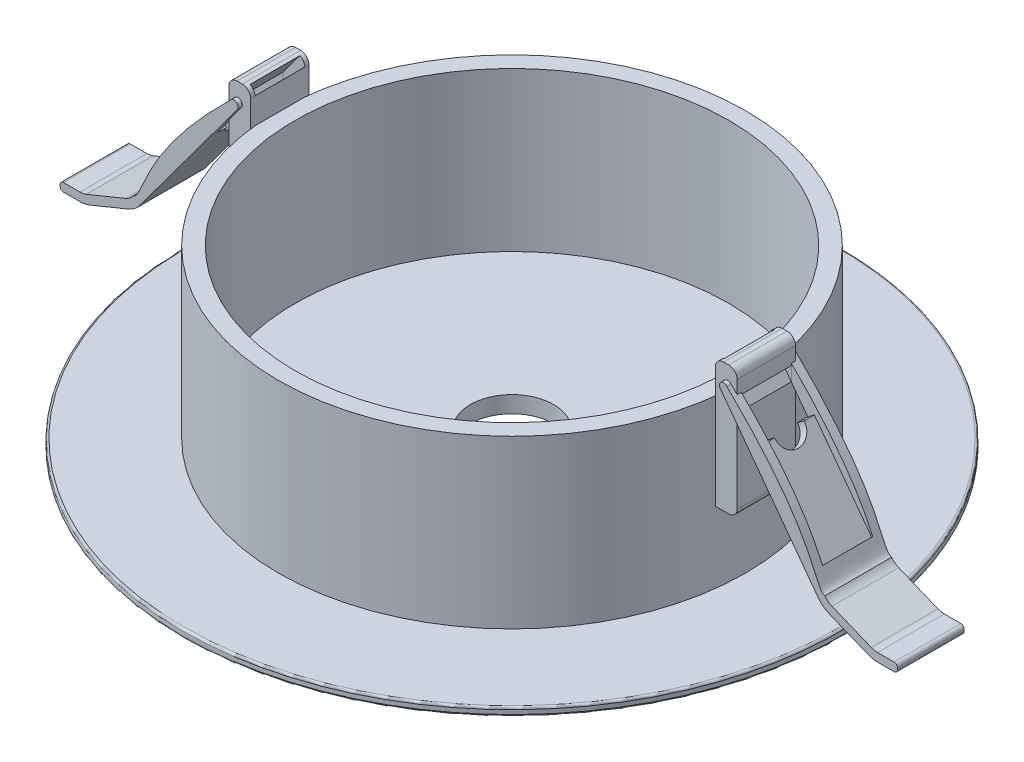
ISO-10303-21;
HEADER;
FILE_DESCRIPTION(('STEP AP214'),'2;1');
FILE_NAME('part.step','',(''),(''),'','','');
FILE_SCHEMA(('AUTOMOTIVE_DESIGN { 1 0 10303 214 1 1 1 1 }'));
ENDSEC;
DATA;
#1=APPLICATION_CONTEXT('core data for automotive mechanical design processes');
#2=APPLICATION_PROTOCOL_DEFINITION('international standard','automotive_design',2000,#1);
#3=PRODUCT_CONTEXT('',#1,'mechanical');
#4=PRODUCT('Part','Part','',(#3));
#5=PRODUCT_RELATED_PRODUCT_CATEGORY('part','',(#4));
#6=PRODUCT_DEFINITION_FORMATION('','',#4);
#7=PRODUCT_DEFINITION_CONTEXT('part definition',#1,'design');
#8=PRODUCT_DEFINITION('design','',#6,#7);
#9=PRODUCT_DEFINITION_SHAPE('','',#8);
#10=(LENGTH_UNIT() NAMED_UNIT(*) SI_UNIT(.MILLI.,.METRE.));
#11=(NAMED_UNIT(*) PLANE_ANGLE_UNIT() SI_UNIT($,.RADIAN.));
#12=(NAMED_UNIT(*) SI_UNIT($,.STERADIAN.) SOLID_ANGLE_UNIT());
#13=UNCERTAINTY_MEASURE_WITH_UNIT(LENGTH_MEASURE(1.E-05),#10,'distance_accuracy_value','');
#14=(GEOMETRIC_REPRESENTATION_CONTEXT(3) GLOBAL_UNCERTAINTY_ASSIGNED_CONTEXT((#13)) GLOBAL_UNIT_ASSIGNED_CONTEXT((#10,
#11,#12)) REPRESENTATION_CONTEXT('',''));
#15=CARTESIAN_POINT('',(0.,0.,0.));
#16=DIRECTION('',(0.,0.,1.));
#17=DIRECTION('',(1.,0.,0.));
#18=AXIS2_PLACEMENT_3D('',#15,#16,#17);
#19=CARTESIAN_POINT('',(-28.8287360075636,24.1000715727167,3.5));
#20=DIRECTION('',(0.,0.,-1.));
#21=DIRECTION('',(-1.,0.,0.));
#22=AXIS2_PLACEMENT_3D('',#19,#20,#21);
#23=CYLINDRICAL_SURFACE('',#22,1.);
#24=CARTESIAN_POINT('',(-28.8287360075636,24.1000715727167,-3.5));
#25=DIRECTION('',(0.,0.,1.));
#26=DIRECTION('',(-1.,0.,0.));
#27=AXIS2_PLACEMENT_3D('',#24,#25,#26);
#28=CIRCLE('',#27,1.);
#29=CARTESIAN_POINT('',(-27.8287360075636,24.1000715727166,-3.5));
#30=VERTEX_POINT('',#29);
#31=CARTESIAN_POINT('',(-28.8287360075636,25.1000715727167,-3.5));
#32=VERTEX_POINT('',#31);
#33=EDGE_CURVE('E185',#30,#32,#28,.T.);
#34=ORIENTED_EDGE('',*,*,#33,.T.);
#35=DIRECTION('',(0.,0.,-1.));
#36=VECTOR('',#35,1.);
#37=CARTESIAN_POINT('',(-28.8287360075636,25.1000715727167,3.5));
#38=LINE('',#37,#36);
#39=CARTESIAN_POINT('',(-28.8287360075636,25.1000715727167,3.5));
#40=VERTEX_POINT('',#39);
#41=EDGE_CURVE('E155',#40,#32,#38,.T.);
#42=ORIENTED_EDGE('',*,*,#41,.F.);
#43=CARTESIAN_POINT('',(-28.8287360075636,24.1000715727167,3.5));
#44=DIRECTION('',(0.,0.,1.));
#45=DIRECTION('',(-1.,0.,0.));
#46=AXIS2_PLACEMENT_3D('',#43,#44,#45);
#47=CIRCLE('',#46,1.);
#48=CARTESIAN_POINT('',(-27.8287360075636,24.1000715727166,3.5));
#49=VERTEX_POINT('',#48);
#50=EDGE_CURVE('E199',#49,#40,#47,.T.);
#51=ORIENTED_EDGE('',*,*,#50,.F.);
#52=DIRECTION('',(0.,0.,-1.));
#53=VECTOR('',#52,1.);
#54=CARTESIAN_POINT('',(-27.8287360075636,24.1000715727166,3.5));
#55=LINE('',#54,#53);
#56=EDGE_CURVE('E139',#49,#30,#55,.T.);
#57=ORIENTED_EDGE('',*,*,#56,.T.);
#58=EDGE_LOOP('',(#34,#42,#51,#57));
#59=FACE_BOUND('',#58,.T.);
#60=DIRECTION('',(0.,0.,-1.));
#61=VECTOR('',#60,1.);
#62=CARTESIAN_POINT('',(-27.8290002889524,24.1230605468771,3.5));
#63=LINE('',#62,#61);
#64=CARTESIAN_POINT('',(-27.8290002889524,24.1230605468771,2.9851983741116));
#65=VERTEX_POINT('',#64);
#66=CARTESIAN_POINT('',(-27.8290002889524,24.1230605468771,-3.));
#67=VERTEX_POINT('',#66);
#68=EDGE_CURVE('E207',#65,#67,#63,.T.);
#69=ORIENTED_EDGE('',*,*,#68,.F.);
#70=CARTESIAN_POINT('',(-28.8287360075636,24.1000715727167,2.9851983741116));
#71=DIRECTION('',(0.,0.,1.));
#72=DIRECTION('',(0.,-1.,0.));
#73=AXIS2_PLACEMENT_3D('',#70,#71,#72);
#74=CIRCLE('',#73,1.);
#75=CARTESIAN_POINT('',(-28.4158843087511,25.0108698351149,2.9851983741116));
#76=VERTEX_POINT('',#75);
#77=EDGE_CURVE('E204',#65,#76,#74,.T.);
#78=ORIENTED_EDGE('',*,*,#77,.T.);
#79=DIRECTION('',(0.,0.,-1.));
#80=VECTOR('',#79,1.);
#81=CARTESIAN_POINT('',(-28.4158843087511,25.0108698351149,3.5));
#82=LINE('',#81,#80);
#83=CARTESIAN_POINT('',(-28.4158843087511,25.0108698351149,-3.));
#84=VERTEX_POINT('',#83);
#85=EDGE_CURVE('E209',#76,#84,#82,.T.);
#86=ORIENTED_EDGE('',*,*,#85,.T.);
#87=CARTESIAN_POINT('',(-28.8287360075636,24.1000715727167,-3.));
#88=DIRECTION('',(0.,0.,-1.));
#89=DIRECTION('',(-1.,0.,0.));
#90=AXIS2_PLACEMENT_3D('',#87,#88,#89);
#91=CIRCLE('',#90,1.);
#92=EDGE_CURVE('E146',#84,#67,#91,.T.);
#93=ORIENTED_EDGE('',*,*,#92,.T.);
#94=EDGE_LOOP('',(#69,#78,#86,#93));
#95=FACE_BOUND('',#94,.T.);
#96=ADVANCED_FACE('F54',(#59,#95),#23,.T.);
#97=CARTESIAN_POINT('',(-30.4379829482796,10.6325847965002,3.5));
#98=DIRECTION('',(1.,0.,0.));
#99=DIRECTION('',(0.,0.,-1.));
#100=AXIS2_PLACEMENT_3D('',#97,#98,#99);
#101=PLANE('',#100);
#102=DIRECTION('',(0.,-1.,0.));
#103=VECTOR('',#102,1.);
#104=CARTESIAN_POINT('',(-30.4379829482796,10.6325847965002,-3.5));
#105=LINE('',#104,#103);
#106=CARTESIAN_POINT('',(-30.4379829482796,24.1000715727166,-3.5));
#107=VERTEX_POINT('',#106);
#108=CARTESIAN_POINT('',(-30.4379829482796,10.6325847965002,-3.5));
#109=VERTEX_POINT('',#108);
#110=EDGE_CURVE('E179',#107,#109,#105,.T.);
#111=ORIENTED_EDGE('',*,*,#110,.T.);
#112=DIRECTION('',(0.,0.,-1.));
#113=VECTOR('',#112,1.);
#114=CARTESIAN_POINT('',(-30.4379829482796,10.6325847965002,3.5));
#115=LINE('',#114,#113);
#116=CARTESIAN_POINT('',(-30.4379829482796,10.6325847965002,3.5));
#117=VERTEX_POINT('',#116);
#118=EDGE_CURVE('E164',#117,#109,#115,.T.);
#119=ORIENTED_EDGE('',*,*,#118,.F.);
#120=DIRECTION('',(0.,-1.,0.));
#121=VECTOR('',#120,1.);
#122=CARTESIAN_POINT('',(-30.4379829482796,10.6325847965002,3.5));
#123=LINE('',#122,#121);
#124=CARTESIAN_POINT('',(-30.4379829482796,24.1000715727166,3.5));
#125=VERTEX_POINT('',#124);
#126=EDGE_CURVE('E193',#125,#117,#123,.T.);
#127=ORIENTED_EDGE('',*,*,#126,.F.);
#128=DIRECTION('',(0.,0.,-1.));
#129=VECTOR('',#128,1.);
#130=CARTESIAN_POINT('',(-30.4379829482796,24.1000715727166,3.5));
#131=LINE('',#130,#129);
#132=EDGE_CURVE('E161',#125,#107,#131,.T.);
#133=ORIENTED_EDGE('',*,*,#132,.T.);
#134=EDGE_LOOP('',(#111,#119,#127,#133));
#135=FACE_BOUND('',#134,.T.);
#136=DIRECTION('',(0.,0.,1.));
#137=VECTOR('',#136,1.);
#138=CARTESIAN_POINT('',(-30.4379829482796,20.6000556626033,3.5));
#139=LINE('',#138,#137);
#140=CARTESIAN_POINT('',(-30.4379829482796,20.6000556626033,-3.));
#141=VERTEX_POINT('',#140);
#142=CARTESIAN_POINT('',(-30.4379829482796,20.6000556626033,2.9851983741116));
#143=VERTEX_POINT('',#142);
#144=EDGE_CURVE('E12',#141,#143,#139,.T.);
#145=ORIENTED_EDGE('',*,*,#144,.F.);
#146=DIRECTION('',(0.,1.,0.));
#147=VECTOR('',#146,1.);
#148=CARTESIAN_POINT('',(-30.4379829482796,10.6325847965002,-3.));
#149=LINE('',#148,#147);
#150=CARTESIAN_POINT('',(-30.4379829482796,22.2803559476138,-3.));
#151=VERTEX_POINT('',#150);
#152=EDGE_CURVE('E62',#141,#151,#149,.T.);
#153=ORIENTED_EDGE('',*,*,#152,.T.);
#154=DIRECTION('',(0.,0.,1.));
#155=VECTOR('',#154,1.);
#156=CARTESIAN_POINT('',(-30.4379829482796,22.2803559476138,3.5));
#157=LINE('',#156,#155);
#158=CARTESIAN_POINT('',(-30.4379829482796,22.2803559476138,2.9851983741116));
#159=VERTEX_POINT('',#158);
#160=EDGE_CURVE('E133',#151,#159,#157,.T.);
#161=ORIENTED_EDGE('',*,*,#160,.T.);
#162=DIRECTION('',(0.,-1.,0.));
#163=VECTOR('',#162,1.);
#164=CARTESIAN_POINT('',(-30.4379829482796,10.6325847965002,2.9851983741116));
#165=LINE('',#164,#163);
#166=EDGE_CURVE('E138',#159,#143,#165,.T.);
#167=ORIENTED_EDGE('',*,*,#166,.T.);
#168=EDGE_LOOP('',(#145,#153,#161,#167));
#169=FACE_BOUND('',#168,.T.);
#170=ADVANCED_FACE('F150',(#135,#169),#101,.F.);
#171=CARTESIAN_POINT('',(-27.8287360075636,9.63258479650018,3.5));
#172=DIRECTION('',(-1.,0.,0.));
#173=DIRECTION('',(0.,0.,1.));
#174=AXIS2_PLACEMENT_3D('',#171,#172,#173);
#175=PLANE('',#174);
#176=DIRECTION('',(0.,1.,0.));
#177=VECTOR('',#176,1.);
#178=CARTESIAN_POINT('',(-27.8287360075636,9.63258479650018,-3.5));
#179=LINE('',#178,#177);
#180=CARTESIAN_POINT('',(-27.8287360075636,9.63258479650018,-3.5));
#181=VERTEX_POINT('',#180);
#182=EDGE_CURVE('E187',#181,#30,#179,.T.);
#183=ORIENTED_EDGE('',*,*,#182,.T.);
#184=ORIENTED_EDGE('',*,*,#56,.F.);
#185=DIRECTION('',(0.,1.,0.));
#186=VECTOR('',#185,1.);
#187=CARTESIAN_POINT('',(-27.8287360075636,9.63258479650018,3.5));
#188=LINE('',#187,#186);
#189=CARTESIAN_POINT('',(-27.8287360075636,9.63258479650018,3.5));
#190=VERTEX_POINT('',#189);
#191=EDGE_CURVE('E176',#190,#49,#188,.T.);
#192=ORIENTED_EDGE('',*,*,#191,.F.);
#193=DIRECTION('',(0.,0.,-1.));
#194=VECTOR('',#193,1.);
#195=CARTESIAN_POINT('',(-27.8287360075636,9.63258479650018,3.5));
#196=LINE('',#195,#194);
#197=EDGE_CURVE('E170',#190,#181,#196,.T.);
#198=ORIENTED_EDGE('',*,*,#197,.T.);
#199=EDGE_LOOP('',(#183,#184,#192,#198));
#200=FACE_BOUND('',#199,.T.);
#201=ADVANCED_FACE('F56',(#200),#175,.F.);
#202=CARTESIAN_POINT('',(-29.4379829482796,25.1000715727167,3.5));
#203=DIRECTION('',(0.,-1.,0.));
#204=DIRECTION('',(0.,0.,-1.));
#205=AXIS2_PLACEMENT_3D('',#202,#203,#204);
#206=PLANE('',#205);
#207=DIRECTION('',(-1.,0.,0.));
#208=VECTOR('',#207,1.);
#209=CARTESIAN_POINT('',(-29.4379829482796,25.1000715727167,-3.5));
#210=LINE('',#209,#208);
#211=CARTESIAN_POINT('',(-29.4379829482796,25.1000715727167,-3.5));
#212=VERTEX_POINT('',#211);
#213=EDGE_CURVE('E183',#32,#212,#210,.T.);
#214=ORIENTED_EDGE('',*,*,#213,.T.);
#215=DIRECTION('',(0.,0.,-1.));
#216=VECTOR('',#215,1.);
#217=CARTESIAN_POINT('',(-29.4379829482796,25.1000715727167,3.5));
#218=LINE('',#217,#216);
#219=CARTESIAN_POINT('',(-29.4379829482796,25.1000715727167,3.5));
#220=VERTEX_POINT('',#219);
#221=EDGE_CURVE('E158',#220,#212,#218,.T.);
#222=ORIENTED_EDGE('',*,*,#221,.F.);
#223=DIRECTION('',(-1.,0.,0.));
#224=VECTOR('',#223,1.);
#225=CARTESIAN_POINT('',(-29.4379829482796,25.1000715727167,3.5));
#226=LINE('',#225,#224);
#227=EDGE_CURVE('E197',#40,#220,#226,.T.);
#228=ORIENTED_EDGE('',*,*,#227,.F.);
#229=ORIENTED_EDGE('',*,*,#41,.T.);
#230=EDGE_LOOP('',(#214,#222,#228,#229));
#231=FACE_BOUND('',#230,.T.);
#232=ADVANCED_FACE('F241',(#231),#206,.F.);
#233=CARTESIAN_POINT('',(-29.4379829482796,24.1000715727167,3.5));
#234=DIRECTION('',(0.,0.,-1.));
#235=DIRECTION('',(-1.,0.,0.));
#236=AXIS2_PLACEMENT_3D('',#233,#234,#235);
#237=CYLINDRICAL_SURFACE('',#236,1.);
#238=CARTESIAN_POINT('',(-29.4379829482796,24.1000715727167,-3.5));
#239=DIRECTION('',(0.,0.,1.));
#240=DIRECTION('',(-1.,0.,0.));
#241=AXIS2_PLACEMENT_3D('',#238,#239,#240);
#242=CIRCLE('',#241,1.);
#243=EDGE_CURVE('E181',#212,#107,#242,.T.);
#244=ORIENTED_EDGE('',*,*,#243,.T.);
#245=ORIENTED_EDGE('',*,*,#132,.F.);
#246=CARTESIAN_POINT('',(-29.4379829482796,24.1000715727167,3.5));
#247=DIRECTION('',(0.,0.,1.));
#248=DIRECTION('',(-1.,0.,0.));
#249=AXIS2_PLACEMENT_3D('',#246,#247,#248);
#250=CIRCLE('',#249,1.);
#251=EDGE_CURVE('E195',#220,#125,#250,.T.);
#252=ORIENTED_EDGE('',*,*,#251,.F.);
#253=ORIENTED_EDGE('',*,*,#221,.T.);
#254=EDGE_LOOP('',(#244,#245,#252,#253));
#255=FACE_BOUND('',#254,.T.);
#256=ADVANCED_FACE('F244',(#255),#237,.T.);
#257=CARTESIAN_POINT('',(-29.4379829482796,10.6325847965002,3.5));
#258=DIRECTION('',(0.,0.,-1.));
#259=DIRECTION('',(-1.,0.,0.));
#260=AXIS2_PLACEMENT_3D('',#257,#258,#259);
#261=CYLINDRICAL_SURFACE('',#260,1.);
#262=CARTESIAN_POINT('',(-29.4379829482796,10.6325847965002,-3.5));
#263=DIRECTION('',(0.,0.,1.));
#264=DIRECTION('',(-1.,0.,0.));
#265=AXIS2_PLACEMENT_3D('',#262,#263,#264);
#266=CIRCLE('',#265,1.);
#267=CARTESIAN_POINT('',(-29.4379829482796,9.63258479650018,-3.5));
#268=VERTEX_POINT('',#267);
#269=EDGE_CURVE('E177',#109,#268,#266,.T.);
#270=ORIENTED_EDGE('',*,*,#269,.T.);
#271=DIRECTION('',(0.,0.,-1.));
#272=VECTOR('',#271,1.);
#273=CARTESIAN_POINT('',(-29.4379829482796,9.63258479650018,3.5));
#274=LINE('',#273,#272);
#275=CARTESIAN_POINT('',(-29.4379829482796,9.63258479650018,3.5));
#276=VERTEX_POINT('',#275);
#277=EDGE_CURVE('E167',#276,#268,#274,.T.);
#278=ORIENTED_EDGE('',*,*,#277,.F.);
#279=CARTESIAN_POINT('',(-29.4379829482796,10.6325847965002,3.5));
#280=DIRECTION('',(0.,0.,1.));
#281=DIRECTION('',(-1.,0.,0.));
#282=AXIS2_PLACEMENT_3D('',#279,#280,#281);
#283=CIRCLE('',#282,1.);
#284=EDGE_CURVE('E191',#117,#276,#283,.T.);
#285=ORIENTED_EDGE('',*,*,#284,.F.);
#286=ORIENTED_EDGE('',*,*,#118,.T.);
#287=EDGE_LOOP('',(#270,#278,#285,#286));
#288=FACE_BOUND('',#287,.T.);
#289=ADVANCED_FACE('F247',(#288),#261,.T.);
#290=CARTESIAN_POINT('',(-29.4379829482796,9.63258479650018,3.5));
#291=DIRECTION('',(0.,1.,0.));
#292=DIRECTION('',(0.,0.,1.));
#293=AXIS2_PLACEMENT_3D('',#290,#291,#292);
#294=PLANE('',#293);
#295=DIRECTION('',(1.,0.,0.));
#296=VECTOR('',#295,1.);
#297=CARTESIAN_POINT('',(-29.4379829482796,9.63258479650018,-3.5));
#298=LINE('',#297,#296);
#299=EDGE_CURVE('E174',#268,#181,#298,.T.);
#300=ORIENTED_EDGE('',*,*,#299,.T.);
#301=ORIENTED_EDGE('',*,*,#197,.F.);
#302=DIRECTION('',(1.,0.,0.));
#303=VECTOR('',#302,1.);
#304=CARTESIAN_POINT('',(-29.4379829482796,9.63258479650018,3.5));
#305=LINE('',#304,#303);
#306=EDGE_CURVE('E173',#276,#190,#305,.T.);
#307=ORIENTED_EDGE('',*,*,#306,.F.);
#308=ORIENTED_EDGE('',*,*,#277,.T.);
#309=EDGE_LOOP('',(#300,#301,#307,#308));
#310=FACE_BOUND('',#309,.T.);
#311=ADVANCED_FACE('F252',(#310),#294,.F.);
#312=CARTESIAN_POINT('',(-28.8287360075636,24.1000715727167,3.5));
#313=DIRECTION('',(0.,0.,-1.));
#314=DIRECTION('',(-1.,0.,0.));
#315=AXIS2_PLACEMENT_3D('',#312,#313,#314);
#316=PLANE('',#315);
#317=ORIENTED_EDGE('',*,*,#191,.T.);
#318=ORIENTED_EDGE('',*,*,#50,.T.);
#319=ORIENTED_EDGE('',*,*,#227,.T.);
#320=ORIENTED_EDGE('',*,*,#251,.T.);
#321=ORIENTED_EDGE('',*,*,#126,.T.);
#322=ORIENTED_EDGE('',*,*,#284,.T.);
#323=ORIENTED_EDGE('',*,*,#306,.T.);
#324=EDGE_LOOP('',(#317,#318,#319,#320,#321,#322,#323));
#325=FACE_BOUND('',#324,.T.);
#326=ADVANCED_FACE('F256',(#325),#316,.F.);
#327=CARTESIAN_POINT('',(-28.8287360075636,24.1000715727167,-3.5));
#328=DIRECTION('',(0.,0.,-1.));
#329=DIRECTION('',(-1.,0.,0.));
#330=AXIS2_PLACEMENT_3D('',#327,#328,#329);
#331=PLANE('',#330);
#332=ORIENTED_EDGE('',*,*,#182,.F.);
#333=ORIENTED_EDGE('',*,*,#299,.F.);
#334=ORIENTED_EDGE('',*,*,#269,.F.);
#335=ORIENTED_EDGE('',*,*,#110,.F.);
#336=ORIENTED_EDGE('',*,*,#243,.F.);
#337=ORIENTED_EDGE('',*,*,#213,.F.);
#338=ORIENTED_EDGE('',*,*,#33,.F.);
#339=EDGE_LOOP('',(#332,#333,#334,#335,#336,#337,#338));
#340=FACE_BOUND('',#339,.T.);
#341=ADVANCED_FACE('F230',(#340),#331,.T.);
#342=CARTESIAN_POINT('',(-25.9344722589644,26.6813111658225,-3.));
#343=DIRECTION('',(0.,0.,-1.));
#344=DIRECTION('',(-1.,0.,0.));
#345=AXIS2_PLACEMENT_3D('',#342,#343,#344);
#346=PLANE('',#345);
#347=DIRECTION('',(-0.595131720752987,-0.803628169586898,0.));
#348=VECTOR('',#347,1.);
#349=CARTESIAN_POINT('',(-26.7381004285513,27.2764428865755,-3.));
#350=LINE('',#349,#348);
#351=EDGE_CURVE('E69',#84,#151,#350,.T.);
#352=ORIENTED_EDGE('',*,*,#351,.T.);
#353=ORIENTED_EDGE('',*,*,#152,.F.);
#354=DIRECTION('',(-0.595131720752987,-0.803628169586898,0.));
#355=VECTOR('',#354,1.);
#356=CARTESIAN_POINT('',(-25.9344722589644,26.6813111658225,-3.));
#357=LINE('',#356,#355);
#358=EDGE_CURVE('E212',#67,#141,#357,.T.);
#359=ORIENTED_EDGE('',*,*,#358,.F.);
#360=ORIENTED_EDGE('',*,*,#92,.F.);
#361=EDGE_LOOP('',(#352,#353,#359,#360));
#362=FACE_BOUND('',#361,.T.);
#363=ADVANCED_FACE('F142',(#362),#346,.F.);
#364=CARTESIAN_POINT('',(-25.9344722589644,26.6813111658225,2.9851983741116));
#365=DIRECTION('',(0.,0.,1.));
#366=DIRECTION('',(0.,-1.,0.));
#367=AXIS2_PLACEMENT_3D('',#364,#365,#366);
#368=PLANE('',#367);
#369=DIRECTION('',(0.595131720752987,0.803628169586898,0.));
#370=VECTOR('',#369,1.);
#371=CARTESIAN_POINT('',(-25.9344722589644,26.6813111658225,2.9851983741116));
#372=LINE('',#371,#370);
#373=EDGE_CURVE('E211',#143,#65,#372,.T.);
#374=ORIENTED_EDGE('',*,*,#373,.F.);
#375=ORIENTED_EDGE('',*,*,#166,.F.);
#376=DIRECTION('',(0.595131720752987,0.803628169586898,0.));
#377=VECTOR('',#376,1.);
#378=CARTESIAN_POINT('',(-26.7381004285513,27.2764428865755,2.9851983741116));
#379=LINE('',#378,#377);
#380=EDGE_CURVE('E74',#159,#76,#379,.T.);
#381=ORIENTED_EDGE('',*,*,#380,.T.);
#382=ORIENTED_EDGE('',*,*,#77,.F.);
#383=EDGE_LOOP('',(#374,#375,#381,#382));
#384=FACE_BOUND('',#383,.T.);
#385=ADVANCED_FACE('F222',(#384),#368,.F.);
#386=CARTESIAN_POINT('',(-32.3999045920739,17.9508009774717,-0.00740081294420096));
#387=DIRECTION('',(-0.803628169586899,0.595131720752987,0.));
#388=DIRECTION('',(-0.595131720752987,-0.803628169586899,0.));
#389=AXIS2_PLACEMENT_3D('',#386,#387,#388);
#390=PLANE('',#389);
#391=ORIENTED_EDGE('',*,*,#68,.T.);
#392=ORIENTED_EDGE('',*,*,#358,.T.);
#393=ORIENTED_EDGE('',*,*,#144,.T.);
#394=ORIENTED_EDGE('',*,*,#373,.T.);
#395=EDGE_LOOP('',(#391,#392,#393,#394));
#396=FACE_BOUND('',#395,.T.);
#397=ADVANCED_FACE('F217',(#396),#390,.T.);
#398=CARTESIAN_POINT('',(-33.2035327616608,18.5459326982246,-0.00740081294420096));
#399=DIRECTION('',(-0.803628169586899,0.595131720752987,0.));
#400=DIRECTION('',(-0.595131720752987,-0.803628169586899,0.));
#401=AXIS2_PLACEMENT_3D('',#398,#399,#400);
#402=PLANE('',#401);
#403=ORIENTED_EDGE('',*,*,#380,.F.);
#404=ORIENTED_EDGE('',*,*,#160,.F.);
#405=ORIENTED_EDGE('',*,*,#351,.F.);
#406=ORIENTED_EDGE('',*,*,#85,.F.);
#407=EDGE_LOOP('',(#403,#404,#405,#406));
#408=FACE_BOUND('',#407,.T.);
#409=ADVANCED_FACE('F134',(#408),#402,.F.);
#410=CLOSED_SHELL('',(#96,#170,#201,#232,#256,#289,#311,#326,#341,#363,#385,#397,#409));
#411=MANIFOLD_SOLID_BREP('B2',#410);
#412=CARTESIAN_POINT('',(-29.322211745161,22.9468725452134,4.));
#413=DIRECTION('',(0.,0.,-1.));
#414=DIRECTION('',(-1.,0.,0.));
#415=AXIS2_PLACEMENT_3D('',#412,#413,#414);
#416=CYLINDRICAL_SURFACE('',#415,0.500000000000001);
#417=DIRECTION('',(0.,0.,-1.));
#418=VECTOR('',#417,1.);
#419=CARTESIAN_POINT('',(-29.7240258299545,23.2444384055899,4.));
#420=LINE('',#419,#418);
#421=CARTESIAN_POINT('',(-29.7240258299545,23.2444384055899,-3.));
#422=VERTEX_POINT('',#421);
#423=CARTESIAN_POINT('',(-29.7240258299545,23.2444384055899,-4.));
#424=VERTEX_POINT('',#423);
#425=EDGE_CURVE('E416',#422,#424,#420,.T.);
#426=ORIENTED_EDGE('',*,*,#425,.F.);
#427=CARTESIAN_POINT('',(-29.322211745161,22.9468725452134,-3.));
#428=DIRECTION('',(0.,0.,-1.));
#429=DIRECTION('',(-1.,0.,0.));
#430=AXIS2_PLACEMENT_3D('',#427,#428,#429);
#431=CIRCLE('',#430,0.500000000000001);
#432=CARTESIAN_POINT('',(-28.9203976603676,22.649306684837,-3.));
#433=VERTEX_POINT('',#432);
#434=EDGE_CURVE('E698',#422,#433,#431,.T.);
#435=ORIENTED_EDGE('',*,*,#434,.T.);
#436=DIRECTION('',(0.,0.,-1.));
#437=VECTOR('',#436,1.);
#438=CARTESIAN_POINT('',(-28.9203976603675,22.6493066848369,4.));
#439=LINE('',#438,#437);
#440=CARTESIAN_POINT('',(-28.9203976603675,22.6493066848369,-4.));
#441=VERTEX_POINT('',#440);
#442=EDGE_CURVE('E484',#433,#441,#439,.T.);
#443=ORIENTED_EDGE('',*,*,#442,.T.);
#444=CARTESIAN_POINT('',(-29.322211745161,22.9468725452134,-4.));
#445=DIRECTION('',(0.,0.,1.));
#446=DIRECTION('',(1.,0.,0.));
#447=AXIS2_PLACEMENT_3D('',#444,#445,#446);
#448=CIRCLE('',#447,0.500000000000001);
#449=EDGE_CURVE('E553',#441,#424,#448,.T.);
#450=ORIENTED_EDGE('',*,*,#449,.T.);
#451=EDGE_LOOP('',(#426,#435,#443,#450));
#452=FACE_BOUND('',#451,.T.);
#453=ADVANCED_FACE('F408',(#452),#416,.T.);
#454=CARTESIAN_POINT('',(-29.7240258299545,23.2444384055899,4.));
#455=CARTESIAN_POINT('',(-40.6870270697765,12.5997411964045,4.));
#456=CARTESIAN_POINT('',(-39.9439443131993,7.96692643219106,4.));
#457=CARTESIAN_POINT('',(-41.4572970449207,7.40057234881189,4.));
#458=B_SPLINE_CURVE_WITH_KNOTS('',3,(#454,#455,#456,#457),.UNSPECIFIED.,.F.,.F.,(4,4),(0.,1.),.UNSPECIFIED.);
#459=DIRECTION('',(0.,0.,-1.));
#460=VECTOR('',#459,1.);
#461=SURFACE_OF_LINEAR_EXTRUSION('',#458,#460);
#462=CARTESIAN_POINT('',(-29.7240258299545,23.2444384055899,-3.));
#463=CARTESIAN_POINT('',(-30.068503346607,22.909934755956,-3.));
#464=CARTESIAN_POINT('',(-30.4103758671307,22.5727271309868,-3.));
#465=CARTESIAN_POINT('',(-31.0898128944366,21.8908662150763,-3.));
#466=CARTESIAN_POINT('',(-31.4273499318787,21.546185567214,-3.));
#467=CARTESIAN_POINT('',(-32.0968517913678,20.8493497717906,-3.));
#468=CARTESIAN_POINT('',(-32.4287956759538,20.4971744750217,-3.));
#469=CARTESIAN_POINT('',(-33.0857408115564,19.7852336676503,-3.));
#470=CARTESIAN_POINT('',(-33.4107286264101,19.4254557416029,-3.));
#471=CARTESIAN_POINT('',(-34.0523021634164,18.6981050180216,-3.));
#472=CARTESIAN_POINT('',(-34.3688829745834,18.3305278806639,-3.));
#473=CARTESIAN_POINT('',(-34.9857997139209,17.5947176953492,-3.));
#474=CARTESIAN_POINT('',(-35.2863356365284,17.2266526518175,-3.));
#475=CARTESIAN_POINT('',(-35.8762393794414,16.4822076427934,-3.));
#476=CARTESIAN_POINT('',(-36.1656171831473,16.1058356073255,-3.));
#477=CARTESIAN_POINT('',(-36.7313806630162,15.3441464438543,-3.));
#478=CARTESIAN_POINT('',(-37.0077820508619,14.9588410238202,-3.));
#479=CARTESIAN_POINT('',(-37.5455238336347,14.1784925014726,-3.));
#480=CARTESIAN_POINT('',(-37.8068813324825,13.7834612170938,-3.));
#481=CARTESIAN_POINT('',(-38.3122283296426,12.9826476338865,-3.));
#482=CARTESIAN_POINT('',(-38.5562266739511,12.5768709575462,-3.));
#483=CARTESIAN_POINT('',(-38.8750552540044,12.016418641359,-3.));
#484=CARTESIAN_POINT('',(-38.95853916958,11.8666298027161,-3.));
#485=CARTESIAN_POINT('',(-39.1228155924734,11.5655496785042,-3.));
#486=CARTESIAN_POINT('',(-39.2036076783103,11.4142581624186,-3.));
#487=CARTESIAN_POINT('',(-39.3624295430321,11.110212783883,-3.));
#488=CARTESIAN_POINT('',(-39.4404590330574,10.9574587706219,-3.));
#489=CARTESIAN_POINT('',(-39.5940918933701,10.6499175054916,-3.));
#490=CARTESIAN_POINT('',(-39.6696834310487,10.4951243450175,-3.));
#491=CARTESIAN_POINT('',(-39.8182446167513,10.1842975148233,-3.));
#492=CARTESIAN_POINT('',(-39.8912144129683,10.0282639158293,-3.));
#493=CARTESIAN_POINT('',(-39.9990503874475,9.79349333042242,-3.));
#494=CARTESIAN_POINT('',(-40.0347223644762,9.71512447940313,-3.));
#495=CARTESIAN_POINT('',(-40.1056531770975,9.55820168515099,-3.));
#496=CARTESIAN_POINT('',(-40.1409120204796,9.47964774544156,-3.));
#497=CARTESIAN_POINT('',(-40.1760268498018,9.40102987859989,-3.));
#498=B_SPLINE_CURVE_WITH_KNOTS('',3,(#462,#463,#464,#465,#466,#467,#468,#469,#470,#471,#472,
#473,#474,#475,#476,#477,#478,#479,#480,#481,#482,#483,#484,#485,#486,#487,#488,#489,#490,#491,
#492,#493,#494,#495,#496,#497),.UNSPECIFIED.,.F.,.F.,(4,2,2,2,2,2,2,2,2,2,2,2,2,2,2,2,2,4),(0.,
1.44049932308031,2.88770561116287,4.33947732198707,5.79383792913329,7.24903020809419,
8.67438327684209,10.0984299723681,11.5207054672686,12.9413306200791,14.3612265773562,
14.8756534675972,15.390160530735,15.9047212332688,16.4214874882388,16.9382244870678,
17.1965402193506,17.4548510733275),.UNSPECIFIED.);
#499=CARTESIAN_POINT('',(-40.1760268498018,9.40102987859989,-3.));
#500=VERTEX_POINT('',#499);
#501=EDGE_CURVE('E627',#422,#500,#498,.T.);
#502=ORIENTED_EDGE('',*,*,#501,.F.);
#503=ORIENTED_EDGE('',*,*,#425,.T.);
#504=CARTESIAN_POINT('',(-29.7240258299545,23.2444384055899,-4.));
#505=CARTESIAN_POINT('',(-40.6870270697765,12.5997411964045,-4.));
#506=CARTESIAN_POINT('',(-39.9439443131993,7.96692643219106,-4.));
#507=CARTESIAN_POINT('',(-41.4572970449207,7.40057234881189,-4.));
#508=B_SPLINE_CURVE_WITH_KNOTS('',3,(#504,#505,#506,#507),.UNSPECIFIED.,.F.,.F.,(4,4),(0.,1.),.UNSPECIFIED.);
#509=CARTESIAN_POINT('',(-41.4572970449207,7.40057234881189,-4.));
#510=VERTEX_POINT('',#509);
#511=EDGE_CURVE('E555',#424,#510,#508,.T.);
#512=ORIENTED_EDGE('',*,*,#511,.T.);
#513=DIRECTION('',(0.,0.,-1.));
#514=VECTOR('',#513,1.);
#515=CARTESIAN_POINT('',(-41.4572970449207,7.40057234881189,4.));
#516=LINE('',#515,#514);
#517=CARTESIAN_POINT('',(-41.4572970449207,7.40057234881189,4.));
#518=VERTEX_POINT('',#517);
#519=EDGE_CURVE('E615',#518,#510,#516,.T.);
#520=ORIENTED_EDGE('',*,*,#519,.F.);
#521=CARTESIAN_POINT('',(-29.7240258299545,23.2444384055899,4.));
#522=VERTEX_POINT('',#521);
#523=EDGE_CURVE('E492',#522,#518,#458,.T.);
#524=ORIENTED_EDGE('',*,*,#523,.F.);
#525=CARTESIAN_POINT('',(-29.7240258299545,23.2444384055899,3.));
#526=VERTEX_POINT('',#525);
#527=EDGE_CURVE('E52',#522,#526,#420,.T.);
#528=ORIENTED_EDGE('',*,*,#527,.T.);
#529=CARTESIAN_POINT('',(-29.7240258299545,23.2444384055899,3.));
#530=CARTESIAN_POINT('',(-30.068503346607,22.909934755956,3.));
#531=CARTESIAN_POINT('',(-30.4103758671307,22.5727271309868,3.));
#532=CARTESIAN_POINT('',(-31.0898128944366,21.8908662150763,3.));
#533=CARTESIAN_POINT('',(-31.4273499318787,21.546185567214,3.));
#534=CARTESIAN_POINT('',(-32.0968517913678,20.8493497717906,3.));
#535=CARTESIAN_POINT('',(-32.4287956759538,20.4971744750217,3.));
#536=CARTESIAN_POINT('',(-33.0857408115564,19.7852336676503,3.));
#537=CARTESIAN_POINT('',(-33.4107286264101,19.4254557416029,3.));
#538=CARTESIAN_POINT('',(-34.0523021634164,18.6981050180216,3.));
#539=CARTESIAN_POINT('',(-34.3688829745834,18.3305278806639,3.));
#540=CARTESIAN_POINT('',(-34.9857997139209,17.5947176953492,3.));
#541=CARTESIAN_POINT('',(-35.2863356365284,17.2266526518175,3.));
#542=CARTESIAN_POINT('',(-35.8762393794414,16.4822076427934,3.));
#543=CARTESIAN_POINT('',(-36.1656171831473,16.1058356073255,3.));
#544=CARTESIAN_POINT('',(-36.7313806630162,15.3441464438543,3.));
#545=CARTESIAN_POINT('',(-37.0077820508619,14.9588410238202,3.));
#546=CARTESIAN_POINT('',(-37.5455238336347,14.1784925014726,3.));
#547=CARTESIAN_POINT('',(-37.8068813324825,13.7834612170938,3.));
#548=CARTESIAN_POINT('',(-38.3122283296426,12.9826476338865,3.));
#549=CARTESIAN_POINT('',(-38.5562266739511,12.5768709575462,3.));
#550=CARTESIAN_POINT('',(-38.8750552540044,12.016418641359,3.));
#551=CARTESIAN_POINT('',(-38.95853916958,11.8666298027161,3.));
#552=CARTESIAN_POINT('',(-39.1228155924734,11.5655496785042,3.));
#553=CARTESIAN_POINT('',(-39.2036076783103,11.4142581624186,3.));
#554=CARTESIAN_POINT('',(-39.3624295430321,11.110212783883,3.));
#555=CARTESIAN_POINT('',(-39.4404590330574,10.9574587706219,3.));
#556=CARTESIAN_POINT('',(-39.5940918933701,10.6499175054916,3.));
#557=CARTESIAN_POINT('',(-39.6696834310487,10.4951243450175,3.));
#558=CARTESIAN_POINT('',(-39.8182446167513,10.1842975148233,3.));
#559=CARTESIAN_POINT('',(-39.8912144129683,10.0282639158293,3.));
#560=CARTESIAN_POINT('',(-39.9990503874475,9.79349333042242,3.));
#561=CARTESIAN_POINT('',(-40.0347223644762,9.71512447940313,3.));
#562=CARTESIAN_POINT('',(-40.1056531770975,9.55820168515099,3.));
#563=CARTESIAN_POINT('',(-40.1409120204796,9.47964774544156,3.));
#564=CARTESIAN_POINT('',(-40.1760268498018,9.40102987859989,3.));
#565=B_SPLINE_CURVE_WITH_KNOTS('',3,(#529,#530,#531,#532,#533,#534,#535,#536,#537,#538,#539,
#540,#541,#542,#543,#544,#545,#546,#547,#548,#549,#550,#551,#552,#553,#554,#555,#556,#557,#558,
#559,#560,#561,#562,#563,#564),.UNSPECIFIED.,.F.,.F.,(4,2,2,2,2,2,2,2,2,2,2,2,2,2,2,2,2,4),(0.,
1.44049932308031,2.88770561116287,4.33947732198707,5.79383792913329,7.24903020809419,
8.67438327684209,10.0984299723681,11.5207054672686,12.9413306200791,14.3612265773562,
14.8756534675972,15.390160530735,15.9047212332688,16.4214874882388,16.9382244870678,
17.1965402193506,17.4548510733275),.UNSPECIFIED.);
#566=CARTESIAN_POINT('',(-40.1760268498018,9.40102987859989,3.));
#567=VERTEX_POINT('',#566);
#568=EDGE_CURVE('E423',#526,#567,#565,.T.);
#569=ORIENTED_EDGE('',*,*,#568,.T.);
#570=DIRECTION('',(0.,0.,-1.));
#571=VECTOR('',#570,1.);
#572=CARTESIAN_POINT('',(-40.1760268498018,9.40102987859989,3.));
#573=LINE('',#572,#571);
#574=EDGE_CURVE('E848',#567,#500,#573,.T.);
#575=ORIENTED_EDGE('',*,*,#574,.T.);
#576=EDGE_LOOP('',(#502,#503,#512,#520,#524,#528,#569,#575));
#577=FACE_BOUND('',#576,.T.);
#578=ADVANCED_FACE('F623',(#577),#461,.F.);
#579=CARTESIAN_POINT('',(-28.9203976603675,22.6493066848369,4.));
#580=VERTEX_POINT('',#579);
#581=CARTESIAN_POINT('',(-28.9203976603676,22.649306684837,2.9851983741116));
#582=VERTEX_POINT('',#581);
#583=EDGE_CURVE('E587',#580,#582,#439,.T.);
#584=ORIENTED_EDGE('',*,*,#583,.T.);
#585=CARTESIAN_POINT('',(-29.322211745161,22.9468725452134,2.9851983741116));
#586=DIRECTION('',(0.,0.,1.));
#587=DIRECTION('',(0.,-1.,0.));
#588=AXIS2_PLACEMENT_3D('',#585,#586,#587);
#589=CIRCLE('',#588,0.500000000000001);
#590=CARTESIAN_POINT('',(-29.7240258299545,23.2444384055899,2.9851983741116));
#591=VERTEX_POINT('',#590);
#592=EDGE_CURVE('E651',#582,#591,#589,.T.);
#593=ORIENTED_EDGE('',*,*,#592,.T.);
#594=DIRECTION('',(0.,0.,-1.));
#595=VECTOR('',#594,1.);
#596=CARTESIAN_POINT('',(-29.7240258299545,23.2444384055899,3.));
#597=LINE('',#596,#595);
#598=EDGE_CURVE('E732',#526,#591,#597,.T.);
#599=ORIENTED_EDGE('',*,*,#598,.F.);
#600=ORIENTED_EDGE('',*,*,#527,.F.);
#601=CARTESIAN_POINT('',(-29.322211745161,22.9468725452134,4.));
#602=DIRECTION('',(0.,0.,1.));
#603=DIRECTION('',(1.,0.,0.));
#604=AXIS2_PLACEMENT_3D('',#601,#602,#603);
#605=CIRCLE('',#604,0.500000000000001);
#606=EDGE_CURVE('E586',#580,#522,#605,.T.);
#607=ORIENTED_EDGE('',*,*,#606,.F.);
#608=EDGE_LOOP('',(#584,#593,#599,#600,#607));
#609=FACE_BOUND('',#608,.T.);
#610=ADVANCED_FACE('F410',(#609),#416,.T.);
#611=CARTESIAN_POINT('',(-43.0645533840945,8.59083579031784,4.));
#612=DIRECTION('',(0.,0.,-1.));
#613=DIRECTION('',(-1.,0.,0.));
#614=AXIS2_PLACEMENT_3D('',#611,#612,#613);
#615=CYLINDRICAL_SURFACE('',#614,2.);
#616=CARTESIAN_POINT('',(-43.0645533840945,8.59083579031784,-4.));
#617=DIRECTION('',(0.,0.,-1.));
#618=DIRECTION('',(-1.,0.,0.));
#619=AXIS2_PLACEMENT_3D('',#616,#617,#618);
#620=CIRCLE('',#619,2.);
#621=CARTESIAN_POINT('',(-42.3076419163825,6.73959700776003,-4.));
#622=VERTEX_POINT('',#621);
#623=EDGE_CURVE('E560',#510,#622,#620,.T.);
#624=ORIENTED_EDGE('',*,*,#623,.T.);
#625=DIRECTION('',(0.,0.,-1.));
#626=VECTOR('',#625,1.);
#627=CARTESIAN_POINT('',(-42.3076419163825,6.73959700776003,4.));
#628=LINE('',#627,#626);
#629=CARTESIAN_POINT('',(-42.3076419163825,6.73959700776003,4.));
#630=VERTEX_POINT('',#629);
#631=EDGE_CURVE('E613',#630,#622,#628,.T.);
#632=ORIENTED_EDGE('',*,*,#631,.F.);
#633=CARTESIAN_POINT('',(-43.0645533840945,8.59083579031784,4.));
#634=DIRECTION('',(0.,0.,-1.));
#635=DIRECTION('',(-1.,0.,0.));
#636=AXIS2_PLACEMENT_3D('',#633,#634,#635);
#637=CIRCLE('',#636,2.);
#638=EDGE_CURVE('E793',#518,#630,#637,.T.);
#639=ORIENTED_EDGE('',*,*,#638,.F.);
#640=ORIENTED_EDGE('',*,*,#519,.T.);
#641=EDGE_LOOP('',(#624,#632,#639,#640));
#642=FACE_BOUND('',#641,.T.);
#643=ADVANCED_FACE('F638',(#642),#615,.F.);
#644=CARTESIAN_POINT('',(-42.3076419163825,6.73959700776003,4.));
#645=DIRECTION('',(0.37845573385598,-0.925619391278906,0.));
#646=DIRECTION('',(0.925619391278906,0.37845573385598,0.));
#647=AXIS2_PLACEMENT_3D('',#644,#645,#646);
#648=PLANE('',#647);
#649=DIRECTION('',(-0.925619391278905,-0.37845573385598,0.));
#650=VECTOR('',#649,1.);
#651=CARTESIAN_POINT('',(-42.3076419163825,6.73959700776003,-4.));
#652=LINE('',#651,#650);
#653=CARTESIAN_POINT('',(-47.0101579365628,4.81689079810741,-4.));
#654=VERTEX_POINT('',#653);
#655=EDGE_CURVE('E565',#622,#654,#652,.T.);
#656=ORIENTED_EDGE('',*,*,#655,.T.);
#657=DIRECTION('',(0.,0.,-1.));
#658=VECTOR('',#657,1.);
#659=CARTESIAN_POINT('',(-47.0101579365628,4.81689079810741,4.));
#660=LINE('',#659,#658);
#661=CARTESIAN_POINT('',(-47.0101579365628,4.81689079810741,4.));
#662=VERTEX_POINT('',#661);
#663=EDGE_CURVE('E610',#662,#654,#660,.T.);
#664=ORIENTED_EDGE('',*,*,#663,.F.);
#665=DIRECTION('',(-0.925619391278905,-0.37845573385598,0.));
#666=VECTOR('',#665,1.);
#667=CARTESIAN_POINT('',(-42.3076419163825,6.73959700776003,4.));
#668=LINE('',#667,#666);
#669=EDGE_CURVE('E798',#630,#662,#668,.T.);
#670=ORIENTED_EDGE('',*,*,#669,.F.);
#671=ORIENTED_EDGE('',*,*,#631,.T.);
#672=EDGE_LOOP('',(#656,#664,#670,#671));
#673=FACE_BOUND('',#672,.T.);
#674=ADVANCED_FACE('F643',(#673),#648,.F.);
#675=CARTESIAN_POINT('',(-47.7670694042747,6.66812958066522,4.));
#676=DIRECTION('',(0.,0.,-1.));
#677=DIRECTION('',(-1.,0.,0.));
#678=AXIS2_PLACEMENT_3D('',#675,#676,#677);
#679=CYLINDRICAL_SURFACE('',#678,2.);
#680=CARTESIAN_POINT('',(-47.7670694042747,6.66812958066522,-4.));
#681=DIRECTION('',(0.,0.,-1.));
#682=DIRECTION('',(-1.,0.,0.));
#683=AXIS2_PLACEMENT_3D('',#680,#681,#682);
#684=CIRCLE('',#683,2.);
#685=CARTESIAN_POINT('',(-47.7670694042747,4.66812958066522,-4.));
#686=VERTEX_POINT('',#685);
#687=EDGE_CURVE('E567',#654,#686,#684,.T.);
#688=ORIENTED_EDGE('',*,*,#687,.T.);
#689=DIRECTION('',(0.,0.,-1.));
#690=VECTOR('',#689,1.);
#691=CARTESIAN_POINT('',(-47.7670694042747,4.66812958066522,4.));
#692=LINE('',#691,#690);
#693=CARTESIAN_POINT('',(-47.7670694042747,4.66812958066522,4.));
#694=VERTEX_POINT('',#693);
#695=EDGE_CURVE('E607',#694,#686,#692,.T.);
#696=ORIENTED_EDGE('',*,*,#695,.F.);
#697=CARTESIAN_POINT('',(-47.7670694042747,6.66812958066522,4.));
#698=DIRECTION('',(0.,0.,-1.));
#699=DIRECTION('',(-1.,0.,0.));
#700=AXIS2_PLACEMENT_3D('',#697,#698,#699);
#701=CIRCLE('',#700,2.);
#702=EDGE_CURVE('E800',#662,#694,#701,.T.);
#703=ORIENTED_EDGE('',*,*,#702,.F.);
#704=ORIENTED_EDGE('',*,*,#663,.T.);
#705=EDGE_LOOP('',(#688,#696,#703,#704));
#706=FACE_BOUND('',#705,.T.);
#707=ADVANCED_FACE('F781',(#706),#679,.F.);
#708=CARTESIAN_POINT('',(-47.7670694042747,4.66812958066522,4.));
#709=DIRECTION('',(0.,-1.,0.));
#710=DIRECTION('',(1.,0.,0.));
#711=AXIS2_PLACEMENT_3D('',#708,#709,#710);
#712=PLANE('',#711);
#713=DIRECTION('',(-1.,0.,0.));
#714=VECTOR('',#713,1.);
#715=CARTESIAN_POINT('',(-47.7670694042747,4.66812958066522,-4.));
#716=LINE('',#715,#714);
#717=CARTESIAN_POINT('',(-49.7598142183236,4.66812958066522,-4.));
#718=VERTEX_POINT('',#717);
#719=EDGE_CURVE('E569',#686,#718,#716,.T.);
#720=ORIENTED_EDGE('',*,*,#719,.T.);
#721=DIRECTION('',(0.,0.,-1.));
#722=VECTOR('',#721,1.);
#723=CARTESIAN_POINT('',(-49.7598142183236,4.66812958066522,4.));
#724=LINE('',#723,#722);
#725=CARTESIAN_POINT('',(-49.7598142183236,4.66812958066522,4.));
#726=VERTEX_POINT('',#725);
#727=EDGE_CURVE('E604',#726,#718,#724,.T.);
#728=ORIENTED_EDGE('',*,*,#727,.F.);
#729=DIRECTION('',(-1.,0.,0.));
#730=VECTOR('',#729,1.);
#731=CARTESIAN_POINT('',(-47.7670694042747,4.66812958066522,4.));
#732=LINE('',#731,#730);
#733=EDGE_CURVE('E802',#694,#726,#732,.T.);
#734=ORIENTED_EDGE('',*,*,#733,.F.);
#735=ORIENTED_EDGE('',*,*,#695,.T.);
#736=EDGE_LOOP('',(#720,#728,#734,#735));
#737=FACE_BOUND('',#736,.T.);
#738=ADVANCED_FACE('F777',(#737),#712,.F.);
#739=CARTESIAN_POINT('',(-49.7598142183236,4.26812958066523,4.));
#740=DIRECTION('',(0.,0.,-1.));
#741=DIRECTION('',(-1.,0.,0.));
#742=AXIS2_PLACEMENT_3D('',#739,#740,#741);
#743=CYLINDRICAL_SURFACE('',#742,0.399999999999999);
#744=CARTESIAN_POINT('',(-49.7598142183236,4.26812958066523,-4.));
#745=DIRECTION('',(0.,0.,1.));
#746=DIRECTION('',(1.,0.,0.));
#747=AXIS2_PLACEMENT_3D('',#744,#745,#746);
#748=CIRCLE('',#747,0.399999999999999);
#749=CARTESIAN_POINT('',(-50.1598142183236,4.26812958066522,-4.));
#750=VERTEX_POINT('',#749);
#751=EDGE_CURVE('E571',#718,#750,#748,.T.);
#752=ORIENTED_EDGE('',*,*,#751,.T.);
#753=DIRECTION('',(0.,0.,-1.));
#754=VECTOR('',#753,1.);
#755=CARTESIAN_POINT('',(-50.1598142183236,4.26812958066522,4.));
#756=LINE('',#755,#754);
#757=CARTESIAN_POINT('',(-50.1598142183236,4.26812958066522,4.));
#758=VERTEX_POINT('',#757);
#759=EDGE_CURVE('E601',#758,#750,#756,.T.);
#760=ORIENTED_EDGE('',*,*,#759,.F.);
#761=CARTESIAN_POINT('',(-49.7598142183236,4.26812958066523,4.));
#762=DIRECTION('',(0.,0.,1.));
#763=DIRECTION('',(1.,0.,0.));
#764=AXIS2_PLACEMENT_3D('',#761,#762,#763);
#765=CIRCLE('',#764,0.399999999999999);
#766=EDGE_CURVE('E804',#726,#758,#765,.T.);
#767=ORIENTED_EDGE('',*,*,#766,.F.);
#768=ORIENTED_EDGE('',*,*,#727,.T.);
#769=EDGE_LOOP('',(#752,#760,#767,#768));
#770=FACE_BOUND('',#769,.T.);
#771=ADVANCED_FACE('F773',(#770),#743,.T.);
#772=CARTESIAN_POINT('',(-50.1598142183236,4.26812958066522,4.));
#773=DIRECTION('',(1.,0.,0.));
#774=DIRECTION('',(0.,0.,-1.));
#775=AXIS2_PLACEMENT_3D('',#772,#773,#774);
#776=PLANE('',#775);
#777=DIRECTION('',(0.,-1.,0.));
#778=VECTOR('',#777,1.);
#779=CARTESIAN_POINT('',(-50.1598142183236,4.26812958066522,-4.));
#780=LINE('',#779,#778);
#781=CARTESIAN_POINT('',(-50.1598142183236,4.06812958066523,-4.));
#782=VERTEX_POINT('',#781);
#783=EDGE_CURVE('E573',#750,#782,#780,.T.);
#784=ORIENTED_EDGE('',*,*,#783,.T.);
#785=DIRECTION('',(0.,0.,-1.));
#786=VECTOR('',#785,1.);
#787=CARTESIAN_POINT('',(-50.1598142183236,4.06812958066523,4.));
#788=LINE('',#787,#786);
#789=CARTESIAN_POINT('',(-50.1598142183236,4.06812958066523,4.));
#790=VERTEX_POINT('',#789);
#791=EDGE_CURVE('E598',#790,#782,#788,.T.);
#792=ORIENTED_EDGE('',*,*,#791,.F.);
#793=DIRECTION('',(0.,-1.,0.));
#794=VECTOR('',#793,1.);
#795=CARTESIAN_POINT('',(-50.1598142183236,4.26812958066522,4.));
#796=LINE('',#795,#794);
#797=EDGE_CURVE('E806',#758,#790,#796,.T.);
#798=ORIENTED_EDGE('',*,*,#797,.F.);
#799=ORIENTED_EDGE('',*,*,#759,.T.);
#800=EDGE_LOOP('',(#784,#792,#798,#799));
#801=FACE_BOUND('',#800,.T.);
#802=ADVANCED_FACE('F769',(#801),#776,.F.);
#803=CARTESIAN_POINT('',(-49.7598142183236,4.06812958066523,4.));
#804=DIRECTION('',(0.,0.,-1.));
#805=DIRECTION('',(-1.,0.,0.));
#806=AXIS2_PLACEMENT_3D('',#803,#804,#805);
#807=CYLINDRICAL_SURFACE('',#806,0.399999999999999);
#808=CARTESIAN_POINT('',(-49.7598142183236,4.06812958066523,-4.));
#809=DIRECTION('',(0.,0.,1.));
#810=DIRECTION('',(-1.,0.,0.));
#811=AXIS2_PLACEMENT_3D('',#808,#809,#810);
#812=CIRCLE('',#811,0.399999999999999);
#813=CARTESIAN_POINT('',(-49.7598142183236,3.66812958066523,-4.));
#814=VERTEX_POINT('',#813);
#815=EDGE_CURVE('E575',#782,#814,#812,.T.);
#816=ORIENTED_EDGE('',*,*,#815,.T.);
#817=DIRECTION('',(0.,0.,-1.));
#818=VECTOR('',#817,1.);
#819=CARTESIAN_POINT('',(-49.7598142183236,3.66812958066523,4.));
#820=LINE('',#819,#818);
#821=CARTESIAN_POINT('',(-49.7598142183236,3.66812958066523,4.));
#822=VERTEX_POINT('',#821);
#823=EDGE_CURVE('E595',#822,#814,#820,.T.);
#824=ORIENTED_EDGE('',*,*,#823,.F.);
#825=CARTESIAN_POINT('',(-49.7598142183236,4.06812958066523,4.));
#826=DIRECTION('',(0.,0.,1.));
#827=DIRECTION('',(-1.,0.,0.));
#828=AXIS2_PLACEMENT_3D('',#825,#826,#827);
#829=CIRCLE('',#828,0.399999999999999);
#830=EDGE_CURVE('E808',#790,#822,#829,.T.);
#831=ORIENTED_EDGE('',*,*,#830,.F.);
#832=ORIENTED_EDGE('',*,*,#791,.T.);
#833=EDGE_LOOP('',(#816,#824,#831,#832));
#834=FACE_BOUND('',#833,.T.);
#835=ADVANCED_FACE('F765',(#834),#807,.T.);
#836=CARTESIAN_POINT('',(-47.7670694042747,3.66812958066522,4.));
#837=DIRECTION('',(0.,1.,0.));
#838=DIRECTION('',(-1.,0.,0.));
#839=AXIS2_PLACEMENT_3D('',#836,#837,#838);
#840=PLANE('',#839);
#841=DIRECTION('',(1.,0.,0.));
#842=VECTOR('',#841,1.);
#843=CARTESIAN_POINT('',(-47.7670694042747,3.66812958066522,-4.));
#844=LINE('',#843,#842);
#845=CARTESIAN_POINT('',(-47.7670694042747,3.66812958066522,-4.));
#846=VERTEX_POINT('',#845);
#847=EDGE_CURVE('E577',#814,#846,#844,.T.);
#848=ORIENTED_EDGE('',*,*,#847,.T.);
#849=DIRECTION('',(0.,0.,-1.));
#850=VECTOR('',#849,1.);
#851=CARTESIAN_POINT('',(-47.7670694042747,3.66812958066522,4.));
#852=LINE('',#851,#850);
#853=CARTESIAN_POINT('',(-47.7670694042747,3.66812958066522,4.));
#854=VERTEX_POINT('',#853);
#855=EDGE_CURVE('E592',#854,#846,#852,.T.);
#856=ORIENTED_EDGE('',*,*,#855,.F.);
#857=DIRECTION('',(1.,0.,0.));
#858=VECTOR('',#857,1.);
#859=CARTESIAN_POINT('',(-47.7670694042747,3.66812958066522,4.));
#860=LINE('',#859,#858);
#861=EDGE_CURVE('E810',#822,#854,#860,.T.);
#862=ORIENTED_EDGE('',*,*,#861,.F.);
#863=ORIENTED_EDGE('',*,*,#823,.T.);
#864=EDGE_LOOP('',(#848,#856,#862,#863));
#865=FACE_BOUND('',#864,.T.);
#866=ADVANCED_FACE('F761',(#865),#840,.F.);
#867=CARTESIAN_POINT('',(-47.7670694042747,6.66812958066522,4.));
#868=DIRECTION('',(0.,0.,-1.));
#869=DIRECTION('',(-1.,0.,0.));
#870=AXIS2_PLACEMENT_3D('',#867,#868,#869);
#871=CYLINDRICAL_SURFACE('',#870,3.);
#872=CARTESIAN_POINT('',(-47.7670694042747,6.66812958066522,-4.));
#873=DIRECTION('',(0.,0.,1.));
#874=DIRECTION('',(-1.,0.,0.));
#875=AXIS2_PLACEMENT_3D('',#872,#873,#874);
#876=CIRCLE('',#875,3.);
#877=CARTESIAN_POINT('',(-46.6317022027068,3.89127140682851,-4.));
#878=VERTEX_POINT('',#877);
#879=EDGE_CURVE('E579',#846,#878,#876,.T.);
#880=ORIENTED_EDGE('',*,*,#879,.T.);
#881=DIRECTION('',(0.,0.,-1.));
#882=VECTOR('',#881,1.);
#883=CARTESIAN_POINT('',(-46.6317022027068,3.89127140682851,4.));
#884=LINE('',#883,#882);
#885=CARTESIAN_POINT('',(-46.6317022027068,3.89127140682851,4.));
#886=VERTEX_POINT('',#885);
#887=EDGE_CURVE('E544',#886,#878,#884,.T.);
#888=ORIENTED_EDGE('',*,*,#887,.F.);
#889=CARTESIAN_POINT('',(-47.7670694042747,6.66812958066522,4.));
#890=DIRECTION('',(0.,0.,1.));
#891=DIRECTION('',(-1.,0.,0.));
#892=AXIS2_PLACEMENT_3D('',#889,#890,#891);
#893=CIRCLE('',#892,3.);
#894=EDGE_CURVE('E532',#854,#886,#893,.T.);
#895=ORIENTED_EDGE('',*,*,#894,.F.);
#896=ORIENTED_EDGE('',*,*,#855,.T.);
#897=EDGE_LOOP('',(#880,#888,#895,#896));
#898=FACE_BOUND('',#897,.T.);
#899=ADVANCED_FACE('F758',(#898),#871,.T.);
#900=CARTESIAN_POINT('',(-41.9291861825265,5.81397761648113,4.));
#901=DIRECTION('',(-0.37845573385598,0.925619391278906,0.));
#902=DIRECTION('',(-0.925619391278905,-0.37845573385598,0.));
#903=AXIS2_PLACEMENT_3D('',#900,#901,#902);
#904=PLANE('',#903);
#905=DIRECTION('',(0.925619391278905,0.37845573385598,0.));
#906=VECTOR('',#905,1.);
#907=CARTESIAN_POINT('',(-41.9291861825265,5.81397761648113,-4.));
#908=LINE('',#907,#906);
#909=CARTESIAN_POINT('',(-41.9291861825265,5.81397761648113,-4.));
#910=VERTEX_POINT('',#909);
#911=EDGE_CURVE('E541',#878,#910,#908,.T.);
#912=ORIENTED_EDGE('',*,*,#911,.T.);
#913=DIRECTION('',(0.,0.,-1.));
#914=VECTOR('',#913,1.);
#915=CARTESIAN_POINT('',(-41.9291861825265,5.81397761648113,4.));
#916=LINE('',#915,#914);
#917=CARTESIAN_POINT('',(-41.9291861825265,5.81397761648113,4.));
#918=VERTEX_POINT('',#917);
#919=EDGE_CURVE('E538',#918,#910,#916,.T.);
#920=ORIENTED_EDGE('',*,*,#919,.F.);
#921=DIRECTION('',(0.925619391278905,0.37845573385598,0.));
#922=VECTOR('',#921,1.);
#923=CARTESIAN_POINT('',(-41.9291861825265,5.81397761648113,4.));
#924=LINE('',#923,#922);
#925=EDGE_CURVE('E525',#886,#918,#924,.T.);
#926=ORIENTED_EDGE('',*,*,#925,.F.);
#927=ORIENTED_EDGE('',*,*,#887,.T.);
#928=EDGE_LOOP('',(#912,#920,#926,#927));
#929=FACE_BOUND('',#928,.T.);
#930=ADVANCED_FACE('F539',(#929),#904,.F.);
#931=CARTESIAN_POINT('',(-43.0645533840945,8.59083579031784,4.));
#932=DIRECTION('',(0.,0.,-1.));
#933=DIRECTION('',(-1.,0.,0.));
#934=AXIS2_PLACEMENT_3D('',#931,#932,#933);
#935=CYLINDRICAL_SURFACE('',#934,3.);
#936=CARTESIAN_POINT('',(-43.0645533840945,8.59083579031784,-4.));
#937=DIRECTION('',(0.,0.,1.));
#938=DIRECTION('',(-1.,0.,0.));
#939=AXIS2_PLACEMENT_3D('',#936,#937,#938);
#940=CIRCLE('',#939,3.);
#941=CARTESIAN_POINT('',(-40.6536688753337,6.80544062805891,-4.));
#942=VERTEX_POINT('',#941);
#943=EDGE_CURVE('E582',#910,#942,#940,.T.);
#944=ORIENTED_EDGE('',*,*,#943,.T.);
#945=DIRECTION('',(0.,0.,-1.));
#946=VECTOR('',#945,1.);
#947=CARTESIAN_POINT('',(-40.6536688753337,6.80544062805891,4.));
#948=LINE('',#947,#946);
#949=CARTESIAN_POINT('',(-40.6536688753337,6.80544062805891,4.));
#950=VERTEX_POINT('',#949);
#951=EDGE_CURVE('E545',#950,#942,#948,.T.);
#952=ORIENTED_EDGE('',*,*,#951,.F.);
#953=CARTESIAN_POINT('',(-43.0645533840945,8.59083579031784,4.));
#954=DIRECTION('',(0.,0.,1.));
#955=DIRECTION('',(-1.,0.,0.));
#956=AXIS2_PLACEMENT_3D('',#953,#954,#955);
#957=CIRCLE('',#956,3.);
#958=EDGE_CURVE('E529',#918,#950,#957,.T.);
#959=ORIENTED_EDGE('',*,*,#958,.F.);
#960=ORIENTED_EDGE('',*,*,#919,.T.);
#961=EDGE_LOOP('',(#944,#952,#959,#960));
#962=FACE_BOUND('',#961,.T.);
#963=ADVANCED_FACE('F547',(#962),#935,.T.);
#964=CARTESIAN_POINT('',(-28.9203976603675,22.6493066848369,4.));
#965=DIRECTION('',(-0.803628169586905,0.595131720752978,0.));
#966=DIRECTION('',(-0.595131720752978,-0.803628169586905,0.));
#967=AXIS2_PLACEMENT_3D('',#964,#965,#966);
#968=PLANE('',#967);
#969=ORIENTED_EDGE('',*,*,#442,.F.);
#970=DIRECTION('',(-0.595131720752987,-0.803628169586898,0.));
#971=VECTOR('',#970,1.);
#972=CARTESIAN_POINT('',(-25.9344722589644,26.6813111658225,-3.));
#973=LINE('',#972,#971);
#974=CARTESIAN_POINT('',(-32.3999045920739,17.9508009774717,-3.));
#975=VERTEX_POINT('',#974);
#976=EDGE_CURVE('E689',#433,#975,#973,.T.);
#977=ORIENTED_EDGE('',*,*,#976,.T.);
#978=DIRECTION('',(0.,0.,1.));
#979=VECTOR('',#978,1.);
#980=CARTESIAN_POINT('',(-32.3999045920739,17.9508009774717,-3.));
#981=LINE('',#980,#979);
#982=CARTESIAN_POINT('',(-32.3999045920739,17.9508009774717,-1.79478851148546));
#983=VERTEX_POINT('',#982);
#984=EDGE_CURVE('E868',#975,#983,#981,.T.);
#985=ORIENTED_EDGE('',*,*,#984,.T.);
#986=CARTESIAN_POINT('',(-32.3999045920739,17.9508009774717,-0.00740081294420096));
#987=DIRECTION('',(-0.803628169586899,0.595131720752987,0.));
#988=DIRECTION('',(-0.595131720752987,-0.803628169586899,0.));
#989=AXIS2_PLACEMENT_3D('',#986,#987,#988);
#990=CIRCLE('',#989,1.78738769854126);
#991=CARTESIAN_POINT('',(-32.3999045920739,17.9508009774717,1.77998688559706));
#992=VERTEX_POINT('',#991);
#993=EDGE_CURVE('E673',#983,#992,#990,.T.);
#994=ORIENTED_EDGE('',*,*,#993,.T.);
#995=DIRECTION('',(0.,0.,1.));
#996=VECTOR('',#995,1.);
#997=CARTESIAN_POINT('',(-32.3999045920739,17.9508009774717,1.77998688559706));
#998=LINE('',#997,#996);
#999=CARTESIAN_POINT('',(-32.3999045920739,17.9508009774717,2.9851983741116));
#1000=VERTEX_POINT('',#999);
#1001=EDGE_CURVE('E665',#992,#1000,#998,.T.);
#1002=ORIENTED_EDGE('',*,*,#1001,.T.);
#1003=DIRECTION('',(0.595131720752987,0.803628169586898,0.));
#1004=VECTOR('',#1003,1.);
#1005=CARTESIAN_POINT('',(-25.9344722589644,26.6813111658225,2.9851983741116));
#1006=LINE('',#1005,#1004);
#1007=EDGE_CURVE('E661',#1000,#582,#1006,.T.);
#1008=ORIENTED_EDGE('',*,*,#1007,.T.);
#1009=ORIENTED_EDGE('',*,*,#583,.F.);
#1010=DIRECTION('',(0.595131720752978,0.803628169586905,0.));
#1011=VECTOR('',#1010,1.);
#1012=CARTESIAN_POINT('',(-28.9203976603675,22.6493066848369,4.));
#1013=LINE('',#1012,#1011);
#1014=EDGE_CURVE('E432',#950,#580,#1013,.T.);
#1015=ORIENTED_EDGE('',*,*,#1014,.F.);
#1016=ORIENTED_EDGE('',*,*,#951,.T.);
#1017=DIRECTION('',(0.595131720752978,0.803628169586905,0.));
#1018=VECTOR('',#1017,1.);
#1019=CARTESIAN_POINT('',(-28.9203976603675,22.6493066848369,-4.));
#1020=LINE('',#1019,#1018);
#1021=EDGE_CURVE('E584',#942,#441,#1020,.T.);
#1022=ORIENTED_EDGE('',*,*,#1021,.T.);
#1023=EDGE_LOOP('',(#969,#977,#985,#994,#1002,#1008,#1009,#1015,#1016,#1022));
#1024=FACE_BOUND('',#1023,.T.);
#1025=ADVANCED_FACE('F658',(#1024),#968,.F.);
#1026=CARTESIAN_POINT('',(-29.322211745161,22.9468725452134,4.));
#1027=DIRECTION('',(0.,0.,1.));
#1028=DIRECTION('',(1.,0.,0.));
#1029=AXIS2_PLACEMENT_3D('',#1026,#1027,#1028);
#1030=PLANE('',#1029);
#1031=ORIENTED_EDGE('',*,*,#606,.T.);
#1032=ORIENTED_EDGE('',*,*,#523,.T.);
#1033=ORIENTED_EDGE('',*,*,#638,.T.);
#1034=ORIENTED_EDGE('',*,*,#669,.T.);
#1035=ORIENTED_EDGE('',*,*,#702,.T.);
#1036=ORIENTED_EDGE('',*,*,#733,.T.);
#1037=ORIENTED_EDGE('',*,*,#766,.T.);
#1038=ORIENTED_EDGE('',*,*,#797,.T.);
#1039=ORIENTED_EDGE('',*,*,#830,.T.);
#1040=ORIENTED_EDGE('',*,*,#861,.T.);
#1041=ORIENTED_EDGE('',*,*,#894,.T.);
#1042=ORIENTED_EDGE('',*,*,#925,.T.);
#1043=ORIENTED_EDGE('',*,*,#958,.T.);
#1044=ORIENTED_EDGE('',*,*,#1014,.T.);
#1045=EDGE_LOOP('',(#1031,#1032,#1033,#1034,#1035,#1036,#1037,#1038,#1039,#1040,#1041,#1042,
#1043,#1044));
#1046=FACE_BOUND('',#1045,.T.);
#1047=ADVANCED_FACE('F527',(#1046),#1030,.T.);
#1048=CARTESIAN_POINT('',(-29.322211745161,22.9468725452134,-4.));
#1049=DIRECTION('',(0.,0.,1.));
#1050=DIRECTION('',(1.,0.,0.));
#1051=AXIS2_PLACEMENT_3D('',#1048,#1049,#1050);
#1052=PLANE('',#1051);
#1053=ORIENTED_EDGE('',*,*,#449,.F.);
#1054=ORIENTED_EDGE('',*,*,#1021,.F.);
#1055=ORIENTED_EDGE('',*,*,#943,.F.);
#1056=ORIENTED_EDGE('',*,*,#911,.F.);
#1057=ORIENTED_EDGE('',*,*,#879,.F.);
#1058=ORIENTED_EDGE('',*,*,#847,.F.);
#1059=ORIENTED_EDGE('',*,*,#815,.F.);
#1060=ORIENTED_EDGE('',*,*,#783,.F.);
#1061=ORIENTED_EDGE('',*,*,#751,.F.);
#1062=ORIENTED_EDGE('',*,*,#719,.F.);
#1063=ORIENTED_EDGE('',*,*,#687,.F.);
#1064=ORIENTED_EDGE('',*,*,#655,.F.);
#1065=ORIENTED_EDGE('',*,*,#623,.F.);
#1066=ORIENTED_EDGE('',*,*,#511,.F.);
#1067=EDGE_LOOP('',(#1053,#1054,#1055,#1056,#1057,#1058,#1059,#1060,#1061,#1062,#1063,#1064,
#1065,#1066));
#1068=FACE_BOUND('',#1067,.T.);
#1069=ADVANCED_FACE('F630',(#1068),#1052,.F.);
#1070=CARTESIAN_POINT('',(-43.0645533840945,8.59083579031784,4.));
#1071=DIRECTION('',(0.,0.,-1.));
#1072=DIRECTION('',(-1.,0.,0.));
#1073=AXIS2_PLACEMENT_3D('',#1070,#1071,#1072);
#1074=CYLINDRICAL_SURFACE('',#1073,3.);
#1075=CARTESIAN_POINT('',(-43.0645533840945,8.59083579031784,-3.));
#1076=DIRECTION('',(0.,0.,1.));
#1077=DIRECTION('',(1.,0.,0.));
#1078=AXIS2_PLACEMENT_3D('',#1075,#1076,#1077);
#1079=CIRCLE('',#1078,3.);
#1080=CARTESIAN_POINT('',(-40.1265420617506,9.19753956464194,-3.));
#1081=VERTEX_POINT('',#1080);
#1082=EDGE_CURVE('E704',#500,#1081,#1079,.F.);
#1083=ORIENTED_EDGE('',*,*,#1082,.F.);
#1084=ORIENTED_EDGE('',*,*,#574,.F.);
#1085=CARTESIAN_POINT('',(-43.0645533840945,8.59083579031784,3.));
#1086=DIRECTION('',(0.,0.,1.));
#1087=DIRECTION('',(1.,0.,0.));
#1088=AXIS2_PLACEMENT_3D('',#1085,#1086,#1087);
#1089=CIRCLE('',#1088,3.);
#1090=CARTESIAN_POINT('',(-40.1265420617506,9.19753956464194,3.));
#1091=VERTEX_POINT('',#1090);
#1092=EDGE_CURVE('E838',#567,#1091,#1089,.F.);
#1093=ORIENTED_EDGE('',*,*,#1092,.T.);
#1094=DIRECTION('',(0.,0.,-1.));
#1095=VECTOR('',#1094,1.);
#1096=CARTESIAN_POINT('',(-40.1265420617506,9.19753956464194,4.));
#1097=LINE('',#1096,#1095);
#1098=EDGE_CURVE('E556',#1081,#1091,#1097,.F.);
#1099=ORIENTED_EDGE('',*,*,#1098,.F.);
#1100=EDGE_LOOP('',(#1083,#1084,#1093,#1099));
#1101=FACE_BOUND('',#1100,.T.);
#1102=ADVANCED_FACE('F740',(#1101),#1074,.T.);
#1103=CARTESIAN_POINT('',(-29.7240258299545,23.2444384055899,4.));
#1104=DIRECTION('',(-0.803628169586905,0.595131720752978,0.));
#1105=DIRECTION('',(-0.595131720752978,-0.803628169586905,0.));
#1106=AXIS2_PLACEMENT_3D('',#1103,#1104,#1105);
#1107=PLANE('',#1106);
#1108=DIRECTION('',(0.595131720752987,0.803628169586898,0.));
#1109=VECTOR('',#1108,1.);
#1110=CARTESIAN_POINT('',(-26.7381004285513,27.2764428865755,2.9851983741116));
#1111=LINE('',#1110,#1109);
#1112=CARTESIAN_POINT('',(-33.2035327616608,18.5459326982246,2.9851983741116));
#1113=VERTEX_POINT('',#1112);
#1114=EDGE_CURVE('E686',#1113,#591,#1111,.T.);
#1115=ORIENTED_EDGE('',*,*,#1114,.F.);
#1116=DIRECTION('',(0.,0.,1.));
#1117=VECTOR('',#1116,1.);
#1118=CARTESIAN_POINT('',(-33.2035327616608,18.5459326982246,1.77998688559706));
#1119=LINE('',#1118,#1117);
#1120=CARTESIAN_POINT('',(-33.2035327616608,18.5459326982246,1.77998688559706));
#1121=VERTEX_POINT('',#1120);
#1122=EDGE_CURVE('E683',#1121,#1113,#1119,.T.);
#1123=ORIENTED_EDGE('',*,*,#1122,.F.);
#1124=CARTESIAN_POINT('',(-33.2035327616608,18.5459326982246,-0.00740081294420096));
#1125=DIRECTION('',(-0.803628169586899,0.595131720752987,0.));
#1126=DIRECTION('',(-0.595131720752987,-0.803628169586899,0.));
#1127=AXIS2_PLACEMENT_3D('',#1124,#1125,#1126);
#1128=CIRCLE('',#1127,1.78738769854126);
#1129=CARTESIAN_POINT('',(-33.2035327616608,18.5459326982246,-1.79478851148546));
#1130=VERTEX_POINT('',#1129);
#1131=EDGE_CURVE('E680',#1130,#1121,#1128,.T.);
#1132=ORIENTED_EDGE('',*,*,#1131,.F.);
#1133=DIRECTION('',(0.,0.,1.));
#1134=VECTOR('',#1133,1.);
#1135=CARTESIAN_POINT('',(-33.2035327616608,18.5459326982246,-3.));
#1136=LINE('',#1135,#1134);
#1137=CARTESIAN_POINT('',(-33.2035327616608,18.5459326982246,-3.));
#1138=VERTEX_POINT('',#1137);
#1139=EDGE_CURVE('E677',#1138,#1130,#1136,.T.);
#1140=ORIENTED_EDGE('',*,*,#1139,.F.);
#1141=DIRECTION('',(0.595131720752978,0.803628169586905,0.));
#1142=VECTOR('',#1141,1.);
#1143=CARTESIAN_POINT('',(-29.7240258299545,23.2444384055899,-3.));
#1144=LINE('',#1143,#1142);
#1145=EDGE_CURVE('E841',#1081,#1138,#1144,.T.);
#1146=ORIENTED_EDGE('',*,*,#1145,.F.);
#1147=ORIENTED_EDGE('',*,*,#1098,.T.);
#1148=DIRECTION('',(0.595131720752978,0.803628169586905,0.));
#1149=VECTOR('',#1148,1.);
#1150=CARTESIAN_POINT('',(-29.7240258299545,23.2444384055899,3.));
#1151=LINE('',#1150,#1149);
#1152=EDGE_CURVE('E847',#1091,#526,#1151,.T.);
#1153=ORIENTED_EDGE('',*,*,#1152,.T.);
#1154=ORIENTED_EDGE('',*,*,#598,.T.);
#1155=EDGE_LOOP('',(#1115,#1123,#1132,#1140,#1146,#1147,#1153,#1154));
#1156=FACE_BOUND('',#1155,.T.);
#1157=ADVANCED_FACE('F743',(#1156),#1107,.T.);
#1158=CARTESIAN_POINT('',(-29.322211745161,22.9468725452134,3.));
#1159=DIRECTION('',(0.,0.,1.));
#1160=DIRECTION('',(1.,0.,0.));
#1161=AXIS2_PLACEMENT_3D('',#1158,#1159,#1160);
#1162=PLANE('',#1161);
#1163=ORIENTED_EDGE('',*,*,#1092,.F.);
#1164=ORIENTED_EDGE('',*,*,#568,.F.);
#1165=ORIENTED_EDGE('',*,*,#1152,.F.);
#1166=EDGE_LOOP('',(#1163,#1164,#1165));
#1167=FACE_BOUND('',#1166,.T.);
#1168=ADVANCED_FACE('F715',(#1167),#1162,.F.);
#1169=CARTESIAN_POINT('',(-29.322211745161,22.9468725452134,-3.));
#1170=DIRECTION('',(0.,0.,1.));
#1171=DIRECTION('',(1.,0.,0.));
#1172=AXIS2_PLACEMENT_3D('',#1169,#1170,#1171);
#1173=PLANE('',#1172);
#1174=ORIENTED_EDGE('',*,*,#501,.T.);
#1175=ORIENTED_EDGE('',*,*,#1082,.T.);
#1176=ORIENTED_EDGE('',*,*,#1145,.T.);
#1177=DIRECTION('',(-0.803628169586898,0.595131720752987,0.));
#1178=VECTOR('',#1177,1.);
#1179=CARTESIAN_POINT('',(-32.3999045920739,17.9508009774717,-3.));
#1180=LINE('',#1179,#1178);
#1181=EDGE_CURVE('E668',#975,#1138,#1180,.T.);
#1182=ORIENTED_EDGE('',*,*,#1181,.F.);
#1183=ORIENTED_EDGE('',*,*,#976,.F.);
#1184=ORIENTED_EDGE('',*,*,#434,.F.);
#1185=EDGE_LOOP('',(#1174,#1175,#1176,#1182,#1183,#1184));
#1186=FACE_BOUND('',#1185,.T.);
#1187=ADVANCED_FACE('F734',(#1186),#1173,.T.);
#1188=CARTESIAN_POINT('',(-25.9344722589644,26.6813111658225,2.9851983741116));
#1189=DIRECTION('',(0.,0.,1.));
#1190=DIRECTION('',(0.,-1.,0.));
#1191=AXIS2_PLACEMENT_3D('',#1188,#1189,#1190);
#1192=PLANE('',#1191);
#1193=ORIENTED_EDGE('',*,*,#1007,.F.);
#1194=DIRECTION('',(-0.803628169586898,0.595131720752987,0.));
#1195=VECTOR('',#1194,1.);
#1196=CARTESIAN_POINT('',(-32.3999045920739,17.9508009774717,2.9851983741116));
#1197=LINE('',#1196,#1195);
#1198=EDGE_CURVE('E690',#1000,#1113,#1197,.T.);
#1199=ORIENTED_EDGE('',*,*,#1198,.T.);
#1200=ORIENTED_EDGE('',*,*,#1114,.T.);
#1201=ORIENTED_EDGE('',*,*,#592,.F.);
#1202=EDGE_LOOP('',(#1193,#1199,#1200,#1201));
#1203=FACE_BOUND('',#1202,.T.);
#1204=ADVANCED_FACE('F738',(#1203),#1192,.F.);
#1205=CARTESIAN_POINT('',(-32.3999045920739,17.9508009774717,1.77998688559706));
#1206=DIRECTION('',(-0.595131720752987,-0.803628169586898,0.));
#1207=DIRECTION('',(0.803628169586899,-0.595131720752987,0.));
#1208=AXIS2_PLACEMENT_3D('',#1205,#1206,#1207);
#1209=PLANE('',#1208);
#1210=ORIENTED_EDGE('',*,*,#1122,.T.);
#1211=ORIENTED_EDGE('',*,*,#1198,.F.);
#1212=ORIENTED_EDGE('',*,*,#1001,.F.);
#1213=DIRECTION('',(-0.803628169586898,0.595131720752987,0.));
#1214=VECTOR('',#1213,1.);
#1215=CARTESIAN_POINT('',(-32.3999045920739,17.9508009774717,1.77998688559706));
#1216=LINE('',#1215,#1214);
#1217=EDGE_CURVE('E692',#992,#1121,#1216,.T.);
#1218=ORIENTED_EDGE('',*,*,#1217,.T.);
#1219=EDGE_LOOP('',(#1210,#1211,#1212,#1218));
#1220=FACE_BOUND('',#1219,.T.);
#1221=ADVANCED_FACE('F875',(#1220),#1209,.F.);
#1222=CARTESIAN_POINT('',(-32.3999045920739,17.9508009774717,-0.00740081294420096));
#1223=DIRECTION('',(-0.803628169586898,0.595131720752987,0.));
#1224=DIRECTION('',(-0.595131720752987,-0.803628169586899,0.));
#1225=AXIS2_PLACEMENT_3D('',#1222,#1223,#1224);
#1226=CYLINDRICAL_SURFACE('',#1225,1.78738769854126);
#1227=ORIENTED_EDGE('',*,*,#1131,.T.);
#1228=ORIENTED_EDGE('',*,*,#1217,.F.);
#1229=ORIENTED_EDGE('',*,*,#993,.F.);
#1230=DIRECTION('',(-0.803628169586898,0.595131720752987,0.));
#1231=VECTOR('',#1230,1.);
#1232=CARTESIAN_POINT('',(-32.3999045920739,17.9508009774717,-1.79478851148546));
#1233=LINE('',#1232,#1231);
#1234=EDGE_CURVE('E671',#983,#1130,#1233,.T.);
#1235=ORIENTED_EDGE('',*,*,#1234,.T.);
#1236=EDGE_LOOP('',(#1227,#1228,#1229,#1235));
#1237=FACE_BOUND('',#1236,.T.);
#1238=ADVANCED_FACE('F873',(#1237),#1226,.F.);
#1239=CARTESIAN_POINT('',(-32.3999045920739,17.9508009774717,-3.));
#1240=DIRECTION('',(-0.595131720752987,-0.803628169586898,0.));
#1241=DIRECTION('',(0.803628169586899,-0.595131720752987,0.));
#1242=AXIS2_PLACEMENT_3D('',#1239,#1240,#1241);
#1243=PLANE('',#1242);
#1244=ORIENTED_EDGE('',*,*,#1139,.T.);
#1245=ORIENTED_EDGE('',*,*,#1234,.F.);
#1246=ORIENTED_EDGE('',*,*,#984,.F.);
#1247=ORIENTED_EDGE('',*,*,#1181,.T.);
#1248=EDGE_LOOP('',(#1244,#1245,#1246,#1247));
#1249=FACE_BOUND('',#1248,.T.);
#1250=ADVANCED_FACE('F713',(#1249),#1243,.F.);
#1251=CLOSED_SHELL('',(#453,#578,#610,#643,#674,#707,#738,#771,#802,#835,#866,#899,#930,#963,
#1025,#1047,#1069,#1102,#1157,#1168,#1187,#1204,#1221,#1238,#1250));
#1252=MANIFOLD_SOLID_BREP('B6',#1251);
#1253=CARTESIAN_POINT('',(28.8729728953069,24.1000715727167,3.5));
#1254=DIRECTION('',(0.,0.,-1.));
#1255=DIRECTION('',(1.,0.,0.));
#1256=AXIS2_PLACEMENT_3D('',#1253,#1254,#1255);
#1257=CYLINDRICAL_SURFACE('',#1256,1.);
#1258=CARTESIAN_POINT('',(28.8729728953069,24.1000715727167,-3.5));
#1259=DIRECTION('',(0.,0.,-1.));
#1260=DIRECTION('',(1.,0.,0.));
#1261=AXIS2_PLACEMENT_3D('',#1258,#1259,#1260);
#1262=CIRCLE('',#1261,1.);
#1263=CARTESIAN_POINT('',(27.8729728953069,24.1000715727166,-3.5));
#1264=VERTEX_POINT('',#1263);
#1265=CARTESIAN_POINT('',(28.8729728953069,25.1000715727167,-3.5));
#1266=VERTEX_POINT('',#1265);
#1267=EDGE_CURVE('E1258',#1264,#1266,#1262,.T.);
#1268=ORIENTED_EDGE('',*,*,#1267,.F.);
#1269=DIRECTION('',(0.,0.,-1.));
#1270=VECTOR('',#1269,1.);
#1271=CARTESIAN_POINT('',(27.8729728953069,24.1000715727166,3.5));
#1272=LINE('',#1271,#1270);
#1273=CARTESIAN_POINT('',(27.8729728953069,24.1000715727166,3.5));
#1274=VERTEX_POINT('',#1273);
#1275=EDGE_CURVE('E1219',#1274,#1264,#1272,.T.);
#1276=ORIENTED_EDGE('',*,*,#1275,.F.);
#1277=CARTESIAN_POINT('',(28.8729728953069,24.1000715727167,3.5));
#1278=DIRECTION('',(0.,0.,-1.));
#1279=DIRECTION('',(1.,0.,0.));
#1280=AXIS2_PLACEMENT_3D('',#1277,#1278,#1279);
#1281=CIRCLE('',#1280,1.);
#1282=CARTESIAN_POINT('',(28.8729728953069,25.1000715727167,3.5));
#1283=VERTEX_POINT('',#1282);
#1284=EDGE_CURVE('E1276',#1274,#1283,#1281,.T.);
#1285=ORIENTED_EDGE('',*,*,#1284,.T.);
#1286=DIRECTION('',(0.,0.,-1.));
#1287=VECTOR('',#1286,1.);
#1288=CARTESIAN_POINT('',(28.8729728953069,25.1000715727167,3.5));
#1289=LINE('',#1288,#1287);
#1290=EDGE_CURVE('E1223',#1283,#1266,#1289,.T.);
#1291=ORIENTED_EDGE('',*,*,#1290,.T.);
#1292=EDGE_LOOP('',(#1268,#1276,#1285,#1291));
#1293=FACE_BOUND('',#1292,.T.);
#1294=DIRECTION('',(0.,0.,-1.));
#1295=VECTOR('',#1294,1.);
#1296=CARTESIAN_POINT('',(27.8732371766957,24.1230605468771,3.5));
#1297=LINE('',#1296,#1295);
#1298=CARTESIAN_POINT('',(27.8732371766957,24.1230605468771,2.9851983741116));
#1299=VERTEX_POINT('',#1298);
#1300=CARTESIAN_POINT('',(27.8732371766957,24.1230605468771,-3.));
#1301=VERTEX_POINT('',#1300);
#1302=EDGE_CURVE('E1283',#1299,#1301,#1297,.T.);
#1303=ORIENTED_EDGE('',*,*,#1302,.T.);
#1304=CARTESIAN_POINT('',(28.8729728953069,24.1000715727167,-3.));
#1305=DIRECTION('',(0.,0.,1.));
#1306=DIRECTION('',(1.,0.,0.));
#1307=AXIS2_PLACEMENT_3D('',#1304,#1305,#1306);
#1308=CIRCLE('',#1307,1.);
#1309=CARTESIAN_POINT('',(28.4601211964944,25.0108698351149,-3.));
#1310=VERTEX_POINT('',#1309);
#1311=EDGE_CURVE('E1263',#1310,#1301,#1308,.T.);
#1312=ORIENTED_EDGE('',*,*,#1311,.F.);
#1313=DIRECTION('',(0.,0.,-1.));
#1314=VECTOR('',#1313,1.);
#1315=CARTESIAN_POINT('',(28.4601211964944,25.0108698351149,3.5));
#1316=LINE('',#1315,#1314);
#1317=CARTESIAN_POINT('',(28.4601211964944,25.0108698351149,2.9851983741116));
#1318=VERTEX_POINT('',#1317);
#1319=EDGE_CURVE('E1209',#1318,#1310,#1316,.T.);
#1320=ORIENTED_EDGE('',*,*,#1319,.F.);
#1321=CARTESIAN_POINT('',(28.8729728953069,24.1000715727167,2.9851983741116));
#1322=DIRECTION('',(0.,0.,-1.));
#1323=DIRECTION('',(0.,-1.,0.));
#1324=AXIS2_PLACEMENT_3D('',#1321,#1322,#1323);
#1325=CIRCLE('',#1324,1.);
#1326=EDGE_CURVE('E1281',#1299,#1318,#1325,.T.);
#1327=ORIENTED_EDGE('',*,*,#1326,.F.);
#1328=EDGE_LOOP('',(#1303,#1312,#1320,#1327));
#1329=FACE_BOUND('',#1328,.T.);
#1330=ADVANCED_FACE('F1121',(#1293,#1329),#1257,.T.);
#1331=CARTESIAN_POINT('',(30.4822198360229,10.6325847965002,3.5));
#1332=DIRECTION('',(-1.,0.,0.));
#1333=DIRECTION('',(0.,0.,-1.));
#1334=AXIS2_PLACEMENT_3D('',#1331,#1332,#1333);
#1335=PLANE('',#1334);
#1336=DIRECTION('',(0.,-1.,0.));
#1337=VECTOR('',#1336,1.);
#1338=CARTESIAN_POINT('',(30.4822198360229,10.6325847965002,-3.5));
#1339=LINE('',#1338,#1337);
#1340=CARTESIAN_POINT('',(30.4822198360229,24.1000715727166,-3.5));
#1341=VERTEX_POINT('',#1340);
#1342=CARTESIAN_POINT('',(30.4822198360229,10.6325847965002,-3.5));
#1343=VERTEX_POINT('',#1342);
#1344=EDGE_CURVE('E1250',#1341,#1343,#1339,.T.);
#1345=ORIENTED_EDGE('',*,*,#1344,.F.);
#1346=DIRECTION('',(0.,0.,-1.));
#1347=VECTOR('',#1346,1.);
#1348=CARTESIAN_POINT('',(30.4822198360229,24.1000715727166,3.5));
#1349=LINE('',#1348,#1347);
#1350=CARTESIAN_POINT('',(30.4822198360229,24.1000715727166,3.5));
#1351=VERTEX_POINT('',#1350);
#1352=EDGE_CURVE('E1231',#1351,#1341,#1349,.T.);
#1353=ORIENTED_EDGE('',*,*,#1352,.F.);
#1354=DIRECTION('',(0.,-1.,0.));
#1355=VECTOR('',#1354,1.);
#1356=CARTESIAN_POINT('',(30.4822198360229,10.6325847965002,3.5));
#1357=LINE('',#1356,#1355);
#1358=CARTESIAN_POINT('',(30.4822198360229,10.6325847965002,3.5));
#1359=VERTEX_POINT('',#1358);
#1360=EDGE_CURVE('E1268',#1351,#1359,#1357,.T.);
#1361=ORIENTED_EDGE('',*,*,#1360,.T.);
#1362=DIRECTION('',(0.,0.,-1.));
#1363=VECTOR('',#1362,1.);
#1364=CARTESIAN_POINT('',(30.4822198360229,10.6325847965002,3.5));
#1365=LINE('',#1364,#1363);
#1366=EDGE_CURVE('E1234',#1359,#1343,#1365,.T.);
#1367=ORIENTED_EDGE('',*,*,#1366,.T.);
#1368=EDGE_LOOP('',(#1345,#1353,#1361,#1367));
#1369=FACE_BOUND('',#1368,.T.);
#1370=DIRECTION('',(0.,0.,1.));
#1371=VECTOR('',#1370,1.);
#1372=CARTESIAN_POINT('',(30.4822198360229,20.6000556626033,3.5));
#1373=LINE('',#1372,#1371);
#1374=CARTESIAN_POINT('',(30.4822198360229,20.6000556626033,-3.));
#1375=VERTEX_POINT('',#1374);
#1376=CARTESIAN_POINT('',(30.4822198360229,20.6000556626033,2.9851983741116));
#1377=VERTEX_POINT('',#1376);
#1378=EDGE_CURVE('E406',#1375,#1377,#1373,.T.);
#1379=ORIENTED_EDGE('',*,*,#1378,.T.);
#1380=DIRECTION('',(0.,-1.,0.));
#1381=VECTOR('',#1380,1.);
#1382=CARTESIAN_POINT('',(30.4822198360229,10.6325847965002,2.9851983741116));
#1383=LINE('',#1382,#1381);
#1384=CARTESIAN_POINT('',(30.4822198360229,22.2803559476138,2.9851983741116));
#1385=VERTEX_POINT('',#1384);
#1386=EDGE_CURVE('E1217',#1385,#1377,#1383,.T.);
#1387=ORIENTED_EDGE('',*,*,#1386,.F.);
#1388=DIRECTION('',(0.,0.,1.));
#1389=VECTOR('',#1388,1.);
#1390=CARTESIAN_POINT('',(30.4822198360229,22.2803559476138,3.5));
#1391=LINE('',#1390,#1389);
#1392=CARTESIAN_POINT('',(30.4822198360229,22.2803559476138,-3.));
#1393=VERTEX_POINT('',#1392);
#1394=EDGE_CURVE('E1206',#1393,#1385,#1391,.T.);
#1395=ORIENTED_EDGE('',*,*,#1394,.F.);
#1396=DIRECTION('',(0.,1.,0.));
#1397=VECTOR('',#1396,1.);
#1398=CARTESIAN_POINT('',(30.4822198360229,10.6325847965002,-3.));
#1399=LINE('',#1398,#1397);
#1400=EDGE_CURVE('E1129',#1375,#1393,#1399,.T.);
#1401=ORIENTED_EDGE('',*,*,#1400,.F.);
#1402=EDGE_LOOP('',(#1379,#1387,#1395,#1401));
#1403=FACE_BOUND('',#1402,.T.);
#1404=ADVANCED_FACE('F1218',(#1369,#1403),#1335,.F.);
#1405=CARTESIAN_POINT('',(27.8729728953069,9.63258479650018,3.5));
#1406=DIRECTION('',(1.,0.,0.));
#1407=DIRECTION('',(0.,0.,1.));
#1408=AXIS2_PLACEMENT_3D('',#1405,#1406,#1407);
#1409=PLANE('',#1408);
#1410=DIRECTION('',(0.,1.,0.));
#1411=VECTOR('',#1410,1.);
#1412=CARTESIAN_POINT('',(27.8729728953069,9.63258479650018,-3.5));
#1413=LINE('',#1412,#1411);
#1414=CARTESIAN_POINT('',(27.8729728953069,9.63258479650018,-3.5));
#1415=VERTEX_POINT('',#1414);
#1416=EDGE_CURVE('E1261',#1415,#1264,#1413,.T.);
#1417=ORIENTED_EDGE('',*,*,#1416,.F.);
#1418=DIRECTION('',(0.,0.,-1.));
#1419=VECTOR('',#1418,1.);
#1420=CARTESIAN_POINT('',(27.8729728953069,9.63258479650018,3.5));
#1421=LINE('',#1420,#1419);
#1422=CARTESIAN_POINT('',(27.8729728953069,9.63258479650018,3.5));
#1423=VERTEX_POINT('',#1422);
#1424=EDGE_CURVE('E1240',#1423,#1415,#1421,.T.);
#1425=ORIENTED_EDGE('',*,*,#1424,.F.);
#1426=DIRECTION('',(0.,1.,0.));
#1427=VECTOR('',#1426,1.);
#1428=CARTESIAN_POINT('',(27.8729728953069,9.63258479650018,3.5));
#1429=LINE('',#1428,#1427);
#1430=EDGE_CURVE('E1246',#1423,#1274,#1429,.T.);
#1431=ORIENTED_EDGE('',*,*,#1430,.T.);
#1432=ORIENTED_EDGE('',*,*,#1275,.T.);
#1433=EDGE_LOOP('',(#1417,#1425,#1431,#1432));
#1434=FACE_BOUND('',#1433,.T.);
#1435=ADVANCED_FACE('F1123',(#1434),#1409,.F.);
#1436=CARTESIAN_POINT('',(29.4822198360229,25.1000715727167,3.5));
#1437=DIRECTION('',(0.,-1.,0.));
#1438=DIRECTION('',(0.,0.,-1.));
#1439=AXIS2_PLACEMENT_3D('',#1436,#1437,#1438);
#1440=PLANE('',#1439);
#1441=DIRECTION('',(1.,0.,0.));
#1442=VECTOR('',#1441,1.);
#1443=CARTESIAN_POINT('',(29.4822198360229,25.1000715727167,-3.5));
#1444=LINE('',#1443,#1442);
#1445=CARTESIAN_POINT('',(29.4822198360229,25.1000715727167,-3.5));
#1446=VERTEX_POINT('',#1445);
#1447=EDGE_CURVE('E1255',#1266,#1446,#1444,.T.);
#1448=ORIENTED_EDGE('',*,*,#1447,.F.);
#1449=ORIENTED_EDGE('',*,*,#1290,.F.);
#1450=DIRECTION('',(1.,0.,0.));
#1451=VECTOR('',#1450,1.);
#1452=CARTESIAN_POINT('',(29.4822198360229,25.1000715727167,3.5));
#1453=LINE('',#1452,#1451);
#1454=CARTESIAN_POINT('',(29.4822198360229,25.1000715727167,3.5));
#1455=VERTEX_POINT('',#1454);
#1456=EDGE_CURVE('E1273',#1283,#1455,#1453,.T.);
#1457=ORIENTED_EDGE('',*,*,#1456,.T.);
#1458=DIRECTION('',(0.,0.,-1.));
#1459=VECTOR('',#1458,1.);
#1460=CARTESIAN_POINT('',(29.4822198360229,25.1000715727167,3.5));
#1461=LINE('',#1460,#1459);
#1462=EDGE_CURVE('E1228',#1455,#1446,#1461,.T.);
#1463=ORIENTED_EDGE('',*,*,#1462,.T.);
#1464=EDGE_LOOP('',(#1448,#1449,#1457,#1463));
#1465=FACE_BOUND('',#1464,.T.);
#1466=ADVANCED_FACE('F1313',(#1465),#1440,.F.);
#1467=CARTESIAN_POINT('',(29.4822198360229,24.1000715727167,3.5));
#1468=DIRECTION('',(0.,0.,-1.));
#1469=DIRECTION('',(1.,0.,0.));
#1470=AXIS2_PLACEMENT_3D('',#1467,#1468,#1469);
#1471=CYLINDRICAL_SURFACE('',#1470,1.);
#1472=CARTESIAN_POINT('',(29.4822198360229,24.1000715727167,-3.5));
#1473=DIRECTION('',(0.,0.,-1.));
#1474=DIRECTION('',(1.,0.,0.));
#1475=AXIS2_PLACEMENT_3D('',#1472,#1473,#1474);
#1476=CIRCLE('',#1475,1.);
#1477=EDGE_CURVE('E1253',#1446,#1341,#1476,.T.);
#1478=ORIENTED_EDGE('',*,*,#1477,.F.);
#1479=ORIENTED_EDGE('',*,*,#1462,.F.);
#1480=CARTESIAN_POINT('',(29.4822198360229,24.1000715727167,3.5));
#1481=DIRECTION('',(0.,0.,-1.));
#1482=DIRECTION('',(1.,0.,0.));
#1483=AXIS2_PLACEMENT_3D('',#1480,#1481,#1482);
#1484=CIRCLE('',#1483,1.);
#1485=EDGE_CURVE('E1271',#1455,#1351,#1484,.T.);
#1486=ORIENTED_EDGE('',*,*,#1485,.T.);
#1487=ORIENTED_EDGE('',*,*,#1352,.T.);
#1488=EDGE_LOOP('',(#1478,#1479,#1486,#1487));
#1489=FACE_BOUND('',#1488,.T.);
#1490=ADVANCED_FACE('F1316',(#1489),#1471,.T.);
#1491=CARTESIAN_POINT('',(29.4822198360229,10.6325847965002,3.5));
#1492=DIRECTION('',(0.,0.,-1.));
#1493=DIRECTION('',(1.,0.,0.));
#1494=AXIS2_PLACEMENT_3D('',#1491,#1492,#1493);
#1495=CYLINDRICAL_SURFACE('',#1494,1.);
#1496=CARTESIAN_POINT('',(29.4822198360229,10.6325847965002,-3.5));
#1497=DIRECTION('',(0.,0.,-1.));
#1498=DIRECTION('',(1.,0.,0.));
#1499=AXIS2_PLACEMENT_3D('',#1496,#1497,#1498);
#1500=CIRCLE('',#1499,1.);
#1501=CARTESIAN_POINT('',(29.4822198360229,9.63258479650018,-3.5));
#1502=VERTEX_POINT('',#1501);
#1503=EDGE_CURVE('E1247',#1343,#1502,#1500,.T.);
#1504=ORIENTED_EDGE('',*,*,#1503,.F.);
#1505=ORIENTED_EDGE('',*,*,#1366,.F.);
#1506=CARTESIAN_POINT('',(29.4822198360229,10.6325847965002,3.5));
#1507=DIRECTION('',(0.,0.,-1.));
#1508=DIRECTION('',(1.,0.,0.));
#1509=AXIS2_PLACEMENT_3D('',#1506,#1507,#1508);
#1510=CIRCLE('',#1509,1.);
#1511=CARTESIAN_POINT('',(29.4822198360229,9.63258479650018,3.5));
#1512=VERTEX_POINT('',#1511);
#1513=EDGE_CURVE('E1265',#1359,#1512,#1510,.T.);
#1514=ORIENTED_EDGE('',*,*,#1513,.T.);
#1515=DIRECTION('',(0.,0.,-1.));
#1516=VECTOR('',#1515,1.);
#1517=CARTESIAN_POINT('',(29.4822198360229,9.63258479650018,3.5));
#1518=LINE('',#1517,#1516);
#1519=EDGE_CURVE('E1237',#1512,#1502,#1518,.T.);
#1520=ORIENTED_EDGE('',*,*,#1519,.T.);
#1521=EDGE_LOOP('',(#1504,#1505,#1514,#1520));
#1522=FACE_BOUND('',#1521,.T.);
#1523=ADVANCED_FACE('F1319',(#1522),#1495,.T.);
#1524=CARTESIAN_POINT('',(29.4822198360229,9.63258479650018,3.5));
#1525=DIRECTION('',(0.,1.,0.));
#1526=DIRECTION('',(0.,0.,1.));
#1527=AXIS2_PLACEMENT_3D('',#1524,#1525,#1526);
#1528=PLANE('',#1527);
#1529=DIRECTION('',(-1.,0.,0.));
#1530=VECTOR('',#1529,1.);
#1531=CARTESIAN_POINT('',(29.4822198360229,9.63258479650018,-3.5));
#1532=LINE('',#1531,#1530);
#1533=EDGE_CURVE('E1244',#1502,#1415,#1532,.T.);
#1534=ORIENTED_EDGE('',*,*,#1533,.F.);
#1535=ORIENTED_EDGE('',*,*,#1519,.F.);
#1536=DIRECTION('',(-1.,0.,0.));
#1537=VECTOR('',#1536,1.);
#1538=CARTESIAN_POINT('',(29.4822198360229,9.63258479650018,3.5));
#1539=LINE('',#1538,#1537);
#1540=EDGE_CURVE('E1243',#1512,#1423,#1539,.T.);
#1541=ORIENTED_EDGE('',*,*,#1540,.T.);
#1542=ORIENTED_EDGE('',*,*,#1424,.T.);
#1543=EDGE_LOOP('',(#1534,#1535,#1541,#1542));
#1544=FACE_BOUND('',#1543,.T.);
#1545=ADVANCED_FACE('F1324',(#1544),#1528,.F.);
#1546=CARTESIAN_POINT('',(28.8729728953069,24.1000715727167,3.5));
#1547=DIRECTION('',(0.,0.,-1.));
#1548=DIRECTION('',(1.,0.,0.));
#1549=AXIS2_PLACEMENT_3D('',#1546,#1547,#1548);
#1550=PLANE('',#1549);
#1551=ORIENTED_EDGE('',*,*,#1430,.F.);
#1552=ORIENTED_EDGE('',*,*,#1540,.F.);
#1553=ORIENTED_EDGE('',*,*,#1513,.F.);
#1554=ORIENTED_EDGE('',*,*,#1360,.F.);
#1555=ORIENTED_EDGE('',*,*,#1485,.F.);
#1556=ORIENTED_EDGE('',*,*,#1456,.F.);
#1557=ORIENTED_EDGE('',*,*,#1284,.F.);
#1558=EDGE_LOOP('',(#1551,#1552,#1553,#1554,#1555,#1556,#1557));
#1559=FACE_BOUND('',#1558,.T.);
#1560=ADVANCED_FACE('F1328',(#1559),#1550,.F.);
#1561=CARTESIAN_POINT('',(28.8729728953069,24.1000715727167,-3.5));
#1562=DIRECTION('',(0.,0.,-1.));
#1563=DIRECTION('',(1.,0.,0.));
#1564=AXIS2_PLACEMENT_3D('',#1561,#1562,#1563);
#1565=PLANE('',#1564);
#1566=ORIENTED_EDGE('',*,*,#1416,.T.);
#1567=ORIENTED_EDGE('',*,*,#1267,.T.);
#1568=ORIENTED_EDGE('',*,*,#1447,.T.);
#1569=ORIENTED_EDGE('',*,*,#1477,.T.);
#1570=ORIENTED_EDGE('',*,*,#1344,.T.);
#1571=ORIENTED_EDGE('',*,*,#1503,.T.);
#1572=ORIENTED_EDGE('',*,*,#1533,.T.);
#1573=EDGE_LOOP('',(#1566,#1567,#1568,#1569,#1570,#1571,#1572));
#1574=FACE_BOUND('',#1573,.T.);
#1575=ADVANCED_FACE('F1330',(#1574),#1565,.T.);
#1576=CARTESIAN_POINT('',(25.9787091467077,26.6813111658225,-3.));
#1577=DIRECTION('',(0.,0.,-1.));
#1578=DIRECTION('',(1.,0.,0.));
#1579=AXIS2_PLACEMENT_3D('',#1576,#1577,#1578);
#1580=PLANE('',#1579);
#1581=DIRECTION('',(0.595131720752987,-0.803628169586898,0.));
#1582=VECTOR('',#1581,1.);
#1583=CARTESIAN_POINT('',(26.7823373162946,27.2764428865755,-3.));
#1584=LINE('',#1583,#1582);
#1585=EDGE_CURVE('E1136',#1310,#1393,#1584,.T.);
#1586=ORIENTED_EDGE('',*,*,#1585,.F.);
#1587=ORIENTED_EDGE('',*,*,#1311,.T.);
#1588=DIRECTION('',(0.595131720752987,-0.803628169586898,0.));
#1589=VECTOR('',#1588,1.);
#1590=CARTESIAN_POINT('',(25.9787091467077,26.6813111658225,-3.));
#1591=LINE('',#1590,#1589);
#1592=EDGE_CURVE('E1214',#1301,#1375,#1591,.T.);
#1593=ORIENTED_EDGE('',*,*,#1592,.T.);
#1594=ORIENTED_EDGE('',*,*,#1400,.T.);
#1595=EDGE_LOOP('',(#1586,#1587,#1593,#1594));
#1596=FACE_BOUND('',#1595,.T.);
#1597=ADVANCED_FACE('F1213',(#1596),#1580,.F.);
#1598=CARTESIAN_POINT('',(25.9787091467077,26.6813111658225,2.9851983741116));
#1599=DIRECTION('',(0.,0.,1.));
#1600=DIRECTION('',(0.,-1.,0.));
#1601=AXIS2_PLACEMENT_3D('',#1598,#1599,#1600);
#1602=PLANE('',#1601);
#1603=DIRECTION('',(-0.595131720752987,0.803628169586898,0.));
#1604=VECTOR('',#1603,1.);
#1605=CARTESIAN_POINT('',(25.9787091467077,26.6813111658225,2.9851983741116));
#1606=LINE('',#1605,#1604);
#1607=EDGE_CURVE('E1287',#1377,#1299,#1606,.T.);
#1608=ORIENTED_EDGE('',*,*,#1607,.T.);
#1609=ORIENTED_EDGE('',*,*,#1326,.T.);
#1610=DIRECTION('',(-0.595131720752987,0.803628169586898,0.));
#1611=VECTOR('',#1610,1.);
#1612=CARTESIAN_POINT('',(26.7823373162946,27.2764428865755,2.9851983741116));
#1613=LINE('',#1612,#1611);
#1614=EDGE_CURVE('E1144',#1385,#1318,#1613,.T.);
#1615=ORIENTED_EDGE('',*,*,#1614,.F.);
#1616=ORIENTED_EDGE('',*,*,#1386,.T.);
#1617=EDGE_LOOP('',(#1608,#1609,#1615,#1616));
#1618=FACE_BOUND('',#1617,.T.);
#1619=ADVANCED_FACE('F1291',(#1618),#1602,.F.);
#1620=CARTESIAN_POINT('',(32.4441414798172,17.9508009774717,-0.00740081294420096));
#1621=DIRECTION('',(0.803628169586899,0.595131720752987,0.));
#1622=DIRECTION('',(0.595131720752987,-0.803628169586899,0.));
#1623=AXIS2_PLACEMENT_3D('',#1620,#1621,#1622);
#1624=PLANE('',#1623);
#1625=ORIENTED_EDGE('',*,*,#1302,.F.);
#1626=ORIENTED_EDGE('',*,*,#1607,.F.);
#1627=ORIENTED_EDGE('',*,*,#1378,.F.);
#1628=ORIENTED_EDGE('',*,*,#1592,.F.);
#1629=EDGE_LOOP('',(#1625,#1626,#1627,#1628));
#1630=FACE_BOUND('',#1629,.T.);
#1631=ADVANCED_FACE('F1295',(#1630),#1624,.T.);
#1632=CARTESIAN_POINT('',(33.2477696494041,18.5459326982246,-0.00740081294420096));
#1633=DIRECTION('',(0.803628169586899,0.595131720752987,0.));
#1634=DIRECTION('',(0.595131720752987,-0.803628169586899,0.));
#1635=AXIS2_PLACEMENT_3D('',#1632,#1633,#1634);
#1636=PLANE('',#1635);
#1637=ORIENTED_EDGE('',*,*,#1614,.T.);
#1638=ORIENTED_EDGE('',*,*,#1319,.T.);
#1639=ORIENTED_EDGE('',*,*,#1585,.T.);
#1640=ORIENTED_EDGE('',*,*,#1394,.T.);
#1641=EDGE_LOOP('',(#1637,#1638,#1639,#1640));
#1642=FACE_BOUND('',#1641,.T.);
#1643=ADVANCED_FACE('F1204',(#1642),#1636,.F.);
#1644=CLOSED_SHELL('',(#1330,#1404,#1435,#1466,#1490,#1523,#1545,#1560,#1575,#1597,#1619,#1631,#1643));
#1645=MANIFOLD_SOLID_BREP('B46',#1644);
#1646=CARTESIAN_POINT('',(29.3664486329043,22.9468725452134,4.));
#1647=DIRECTION('',(0.,0.,-1.));
#1648=DIRECTION('',(1.,0.,0.));
#1649=AXIS2_PLACEMENT_3D('',#1646,#1647,#1648);
#1650=CYLINDRICAL_SURFACE('',#1649,0.500000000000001);
#1651=DIRECTION('',(0.,0.,-1.));
#1652=VECTOR('',#1651,1.);
#1653=CARTESIAN_POINT('',(29.7682627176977,23.2444384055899,4.));
#1654=LINE('',#1653,#1652);
#1655=CARTESIAN_POINT('',(29.7682627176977,23.2444384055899,-3.));
#1656=VERTEX_POINT('',#1655);
#1657=CARTESIAN_POINT('',(29.7682627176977,23.2444384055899,-4.));
#1658=VERTEX_POINT('',#1657);
#1659=EDGE_CURVE('E1496',#1656,#1658,#1654,.T.);
#1660=ORIENTED_EDGE('',*,*,#1659,.T.);
#1661=CARTESIAN_POINT('',(29.3664486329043,22.9468725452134,-4.));
#1662=DIRECTION('',(0.,0.,-1.));
#1663=DIRECTION('',(-1.,0.,0.));
#1664=AXIS2_PLACEMENT_3D('',#1661,#1662,#1663);
#1665=CIRCLE('',#1664,0.500000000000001);
#1666=CARTESIAN_POINT('',(28.9646345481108,22.6493066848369,-4.));
#1667=VERTEX_POINT('',#1666);
#1668=EDGE_CURVE('E1635',#1667,#1658,#1665,.T.);
#1669=ORIENTED_EDGE('',*,*,#1668,.F.);
#1670=DIRECTION('',(0.,0.,-1.));
#1671=VECTOR('',#1670,1.);
#1672=CARTESIAN_POINT('',(28.9646345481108,22.6493066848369,4.));
#1673=LINE('',#1672,#1671);
#1674=CARTESIAN_POINT('',(28.9646345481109,22.649306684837,-3.));
#1675=VERTEX_POINT('',#1674);
#1676=EDGE_CURVE('E1634',#1675,#1667,#1673,.T.);
#1677=ORIENTED_EDGE('',*,*,#1676,.F.);
#1678=CARTESIAN_POINT('',(29.3664486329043,22.9468725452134,-3.));
#1679=DIRECTION('',(0.,0.,1.));
#1680=DIRECTION('',(1.,0.,0.));
#1681=AXIS2_PLACEMENT_3D('',#1678,#1679,#1680);
#1682=CIRCLE('',#1681,0.500000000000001);
#1683=EDGE_CURVE('E1717',#1656,#1675,#1682,.T.);
#1684=ORIENTED_EDGE('',*,*,#1683,.F.);
#1685=EDGE_LOOP('',(#1660,#1669,#1677,#1684));
#1686=FACE_BOUND('',#1685,.T.);
#1687=ADVANCED_FACE('F1488',(#1686),#1650,.T.);
#1688=CARTESIAN_POINT('',(29.7682627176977,23.2444384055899,4.));
#1689=CARTESIAN_POINT('',(40.7312639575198,12.5997411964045,4.));
#1690=CARTESIAN_POINT('',(39.9881812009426,7.96692643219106,4.));
#1691=CARTESIAN_POINT('',(41.5015339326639,7.40057234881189,4.));
#1692=B_SPLINE_CURVE_WITH_KNOTS('',3,(#1688,#1689,#1690,#1691),.UNSPECIFIED.,.F.,.F.,(4,4),(0.,
1.),.UNSPECIFIED.);
#1693=DIRECTION('',(0.,0.,-1.));
#1694=VECTOR('',#1693,1.);
#1695=SURFACE_OF_LINEAR_EXTRUSION('',#1692,#1694);
#1696=CARTESIAN_POINT('',(29.7682627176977,23.2444384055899,-3.));
#1697=CARTESIAN_POINT('',(30.1127402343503,22.909934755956,-3.));
#1698=CARTESIAN_POINT('',(30.4546127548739,22.5727271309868,-3.));
#1699=CARTESIAN_POINT('',(31.1340497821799,21.8908662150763,-3.));
#1700=CARTESIAN_POINT('',(31.471586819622,21.546185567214,-3.));
#1701=CARTESIAN_POINT('',(32.1410886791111,20.8493497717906,-3.));
#1702=CARTESIAN_POINT('',(32.4730325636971,20.4971744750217,-3.));
#1703=CARTESIAN_POINT('',(33.1299776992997,19.7852336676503,-3.));
#1704=CARTESIAN_POINT('',(33.4549655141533,19.4254557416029,-3.));
#1705=CARTESIAN_POINT('',(34.0965390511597,18.6981050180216,-3.));
#1706=CARTESIAN_POINT('',(34.4131198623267,18.3305278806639,-3.));
#1707=CARTESIAN_POINT('',(35.0300366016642,17.5947176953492,-3.));
#1708=CARTESIAN_POINT('',(35.3305725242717,17.2266526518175,-3.));
#1709=CARTESIAN_POINT('',(35.9204762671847,16.4822076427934,-3.));
#1710=CARTESIAN_POINT('',(36.2098540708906,16.1058356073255,-3.));
#1711=CARTESIAN_POINT('',(36.7756175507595,15.3441464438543,-3.));
#1712=CARTESIAN_POINT('',(37.0520189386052,14.9588410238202,-3.));
#1713=CARTESIAN_POINT('',(37.5897607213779,14.1784925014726,-3.));
#1714=CARTESIAN_POINT('',(37.8511182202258,13.7834612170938,-3.));
#1715=CARTESIAN_POINT('',(38.3564652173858,12.9826476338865,-3.));
#1716=CARTESIAN_POINT('',(38.6004635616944,12.5768709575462,-3.));
#1717=CARTESIAN_POINT('',(38.9192921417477,12.016418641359,-3.));
#1718=CARTESIAN_POINT('',(39.0027760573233,11.8666298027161,-3.));
#1719=CARTESIAN_POINT('',(39.1670524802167,11.5655496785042,-3.));
#1720=CARTESIAN_POINT('',(39.2478445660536,11.4142581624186,-3.));
#1721=CARTESIAN_POINT('',(39.4066664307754,11.110212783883,-3.));
#1722=CARTESIAN_POINT('',(39.4846959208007,10.9574587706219,-3.));
#1723=CARTESIAN_POINT('',(39.6383287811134,10.6499175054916,-3.));
#1724=CARTESIAN_POINT('',(39.713920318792,10.4951243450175,-3.));
#1725=CARTESIAN_POINT('',(39.8624815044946,10.1842975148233,-3.));
#1726=CARTESIAN_POINT('',(39.9354513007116,10.0282639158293,-3.));
#1727=CARTESIAN_POINT('',(40.0432872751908,9.79349333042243,-3.));
#1728=CARTESIAN_POINT('',(40.0789592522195,9.71512447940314,-3.));
#1729=CARTESIAN_POINT('',(40.1498900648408,9.55820168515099,-3.));
#1730=CARTESIAN_POINT('',(40.1851489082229,9.47964774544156,-3.));
#1731=CARTESIAN_POINT('',(40.2202637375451,9.40102987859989,-3.));
#1732=B_SPLINE_CURVE_WITH_KNOTS('',3,(#1696,#1697,#1698,#1699,#1700,#1701,#1702,#1703,#1704,
#1705,#1706,#1707,#1708,#1709,#1710,#1711,#1712,#1713,#1714,#1715,#1716,#1717,#1718,#1719,#1720,
#1721,#1722,#1723,#1724,#1725,#1726,#1727,#1728,#1729,#1730,#1731),.UNSPECIFIED.,.F.,.F.,(4,2,2,
2,2,2,2,2,2,2,2,2,2,2,2,2,2,4),(0.,1.4404993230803,2.88770561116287,4.33947732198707,
5.79383792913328,7.24903020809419,8.6743832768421,10.0984299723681,11.5207054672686,
12.9413306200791,14.3612265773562,14.8756534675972,15.390160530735,15.9047212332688,
16.4214874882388,16.9382244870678,17.1965402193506,17.4548510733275),.UNSPECIFIED.);
#1733=CARTESIAN_POINT('',(40.2202637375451,9.40102987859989,-3.));
#1734=VERTEX_POINT('',#1733);
#1735=EDGE_CURVE('E1723',#1656,#1734,#1732,.T.);
#1736=ORIENTED_EDGE('',*,*,#1735,.T.);
#1737=DIRECTION('',(0.,0.,-1.));
#1738=VECTOR('',#1737,1.);
#1739=CARTESIAN_POINT('',(40.2202637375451,9.40102987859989,3.));
#1740=LINE('',#1739,#1738);
#1741=CARTESIAN_POINT('',(40.2202637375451,9.40102987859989,3.));
#1742=VERTEX_POINT('',#1741);
#1743=EDGE_CURVE('E1759',#1742,#1734,#1740,.T.);
#1744=ORIENTED_EDGE('',*,*,#1743,.F.);
#1745=CARTESIAN_POINT('',(29.7682627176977,23.2444384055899,3.));
#1746=CARTESIAN_POINT('',(30.1127402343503,22.909934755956,3.));
#1747=CARTESIAN_POINT('',(30.4546127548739,22.5727271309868,3.));
#1748=CARTESIAN_POINT('',(31.1340497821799,21.8908662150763,3.));
#1749=CARTESIAN_POINT('',(31.471586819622,21.546185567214,3.));
#1750=CARTESIAN_POINT('',(32.1410886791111,20.8493497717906,3.));
#1751=CARTESIAN_POINT('',(32.4730325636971,20.4971744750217,3.));
#1752=CARTESIAN_POINT('',(33.1299776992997,19.7852336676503,3.));
#1753=CARTESIAN_POINT('',(33.4549655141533,19.4254557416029,3.));
#1754=CARTESIAN_POINT('',(34.0965390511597,18.6981050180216,3.));
#1755=CARTESIAN_POINT('',(34.4131198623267,18.3305278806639,3.));
#1756=CARTESIAN_POINT('',(35.0300366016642,17.5947176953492,3.));
#1757=CARTESIAN_POINT('',(35.3305725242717,17.2266526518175,3.));
#1758=CARTESIAN_POINT('',(35.9204762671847,16.4822076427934,3.));
#1759=CARTESIAN_POINT('',(36.2098540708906,16.1058356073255,3.));
#1760=CARTESIAN_POINT('',(36.7756175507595,15.3441464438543,3.));
#1761=CARTESIAN_POINT('',(37.0520189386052,14.9588410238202,3.));
#1762=CARTESIAN_POINT('',(37.5897607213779,14.1784925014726,3.));
#1763=CARTESIAN_POINT('',(37.8511182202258,13.7834612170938,3.));
#1764=CARTESIAN_POINT('',(38.3564652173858,12.9826476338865,3.));
#1765=CARTESIAN_POINT('',(38.6004635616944,12.5768709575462,3.));
#1766=CARTESIAN_POINT('',(38.9192921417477,12.016418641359,3.));
#1767=CARTESIAN_POINT('',(39.0027760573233,11.8666298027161,3.));
#1768=CARTESIAN_POINT('',(39.1670524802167,11.5655496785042,3.));
#1769=CARTESIAN_POINT('',(39.2478445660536,11.4142581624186,3.));
#1770=CARTESIAN_POINT('',(39.4066664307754,11.110212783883,3.));
#1771=CARTESIAN_POINT('',(39.4846959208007,10.9574587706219,3.));
#1772=CARTESIAN_POINT('',(39.6383287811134,10.6499175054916,3.));
#1773=CARTESIAN_POINT('',(39.713920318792,10.4951243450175,3.));
#1774=CARTESIAN_POINT('',(39.8624815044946,10.1842975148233,3.));
#1775=CARTESIAN_POINT('',(39.9354513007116,10.0282639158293,3.));
#1776=CARTESIAN_POINT('',(40.0432872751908,9.79349333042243,3.));
#1777=CARTESIAN_POINT('',(40.0789592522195,9.71512447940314,3.));
#1778=CARTESIAN_POINT('',(40.1498900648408,9.55820168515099,3.));
#1779=CARTESIAN_POINT('',(40.1851489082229,9.47964774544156,3.));
#1780=CARTESIAN_POINT('',(40.2202637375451,9.40102987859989,3.));
#1781=B_SPLINE_CURVE_WITH_KNOTS('',3,(#1745,#1746,#1747,#1748,#1749,#1750,#1751,#1752,#1753,
#1754,#1755,#1756,#1757,#1758,#1759,#1760,#1761,#1762,#1763,#1764,#1765,#1766,#1767,#1768,#1769,
#1770,#1771,#1772,#1773,#1774,#1775,#1776,#1777,#1778,#1779,#1780),.UNSPECIFIED.,.F.,.F.,(4,2,2,
2,2,2,2,2,2,2,2,2,2,2,2,2,2,4),(0.,1.4404993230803,2.88770561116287,4.33947732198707,
5.79383792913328,7.24903020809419,8.6743832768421,10.0984299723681,11.5207054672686,
12.9413306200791,14.3612265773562,14.8756534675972,15.390160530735,15.9047212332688,
16.4214874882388,16.9382244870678,17.1965402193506,17.4548510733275),.UNSPECIFIED.);
#1782=CARTESIAN_POINT('',(29.7682627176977,23.2444384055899,3.));
#1783=VERTEX_POINT('',#1782);
#1784=EDGE_CURVE('E1750',#1783,#1742,#1781,.T.);
#1785=ORIENTED_EDGE('',*,*,#1784,.F.);
#1786=CARTESIAN_POINT('',(29.7682627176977,23.2444384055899,4.));
#1787=VERTEX_POINT('',#1786);
#1788=EDGE_CURVE('E1119',#1787,#1783,#1654,.T.);
#1789=ORIENTED_EDGE('',*,*,#1788,.F.);
#1790=CARTESIAN_POINT('',(41.5015339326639,7.40057234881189,4.));
#1791=VERTEX_POINT('',#1790);
#1792=EDGE_CURVE('E1849',#1787,#1791,#1692,.T.);
#1793=ORIENTED_EDGE('',*,*,#1792,.T.);
#1794=DIRECTION('',(0.,0.,-1.));
#1795=VECTOR('',#1794,1.);
#1796=CARTESIAN_POINT('',(41.5015339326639,7.40057234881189,4.));
#1797=LINE('',#1796,#1795);
#1798=CARTESIAN_POINT('',(41.5015339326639,7.40057234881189,-4.));
#1799=VERTEX_POINT('',#1798);
#1800=EDGE_CURVE('E1704',#1791,#1799,#1797,.T.);
#1801=ORIENTED_EDGE('',*,*,#1800,.T.);
#1802=CARTESIAN_POINT('',(29.7682627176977,23.2444384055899,-4.));
#1803=CARTESIAN_POINT('',(40.7312639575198,12.5997411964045,-4.));
#1804=CARTESIAN_POINT('',(39.9881812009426,7.96692643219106,-4.));
#1805=CARTESIAN_POINT('',(41.5015339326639,7.40057234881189,-4.));
#1806=B_SPLINE_CURVE_WITH_KNOTS('',3,(#1802,#1803,#1804,#1805),.UNSPECIFIED.,.F.,.F.,(4,4),(0.,
1.),.UNSPECIFIED.);
#1807=EDGE_CURVE('E1637',#1658,#1799,#1806,.T.);
#1808=ORIENTED_EDGE('',*,*,#1807,.F.);
#1809=ORIENTED_EDGE('',*,*,#1659,.F.);
#1810=EDGE_LOOP('',(#1736,#1744,#1785,#1789,#1793,#1801,#1808,#1809));
#1811=FACE_BOUND('',#1810,.T.);
#1812=ADVANCED_FACE('F1719',(#1811),#1695,.T.);
#1813=CARTESIAN_POINT('',(28.9646345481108,22.6493066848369,4.));
#1814=VERTEX_POINT('',#1813);
#1815=CARTESIAN_POINT('',(28.9646345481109,22.649306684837,2.9851983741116));
#1816=VERTEX_POINT('',#1815);
#1817=EDGE_CURVE('E1677',#1814,#1816,#1673,.T.);
#1818=ORIENTED_EDGE('',*,*,#1817,.F.);
#1819=CARTESIAN_POINT('',(29.3664486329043,22.9468725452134,4.));
#1820=DIRECTION('',(0.,0.,-1.));
#1821=DIRECTION('',(-1.,0.,0.));
#1822=AXIS2_PLACEMENT_3D('',#1819,#1820,#1821);
#1823=CIRCLE('',#1822,0.500000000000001);
#1824=EDGE_CURVE('E1570',#1814,#1787,#1823,.T.);
#1825=ORIENTED_EDGE('',*,*,#1824,.T.);
#1826=ORIENTED_EDGE('',*,*,#1788,.T.);
#1827=DIRECTION('',(0.,0.,-1.));
#1828=VECTOR('',#1827,1.);
#1829=CARTESIAN_POINT('',(29.7682627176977,23.2444384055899,3.));
#1830=LINE('',#1829,#1828);
#1831=CARTESIAN_POINT('',(29.7682627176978,23.2444384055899,2.9851983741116));
#1832=VERTEX_POINT('',#1831);
#1833=EDGE_CURVE('E1756',#1783,#1832,#1830,.T.);
#1834=ORIENTED_EDGE('',*,*,#1833,.T.);
#1835=CARTESIAN_POINT('',(29.3664486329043,22.9468725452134,2.9851983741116));
#1836=DIRECTION('',(0.,0.,-1.));
#1837=DIRECTION('',(0.,-1.,0.));
#1838=AXIS2_PLACEMENT_3D('',#1835,#1836,#1837);
#1839=CIRCLE('',#1838,0.500000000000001);
#1840=EDGE_CURVE('E1892',#1816,#1832,#1839,.T.);
#1841=ORIENTED_EDGE('',*,*,#1840,.F.);
#1842=EDGE_LOOP('',(#1818,#1825,#1826,#1834,#1841));
#1843=FACE_BOUND('',#1842,.T.);
#1844=ADVANCED_FACE('F1490',(#1843),#1650,.T.);
#1845=CARTESIAN_POINT('',(43.1087902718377,8.59083579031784,4.));
#1846=DIRECTION('',(0.,0.,-1.));
#1847=DIRECTION('',(1.,0.,0.));
#1848=AXIS2_PLACEMENT_3D('',#1845,#1846,#1847);
#1849=CYLINDRICAL_SURFACE('',#1848,2.);
#1850=CARTESIAN_POINT('',(43.1087902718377,8.59083579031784,-4.));
#1851=DIRECTION('',(0.,0.,1.));
#1852=DIRECTION('',(1.,0.,0.));
#1853=AXIS2_PLACEMENT_3D('',#1850,#1851,#1852);
#1854=CIRCLE('',#1853,2.);
#1855=CARTESIAN_POINT('',(42.3518788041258,6.73959700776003,-4.));
#1856=VERTEX_POINT('',#1855);
#1857=EDGE_CURVE('E1643',#1799,#1856,#1854,.T.);
#1858=ORIENTED_EDGE('',*,*,#1857,.F.);
#1859=ORIENTED_EDGE('',*,*,#1800,.F.);
#1860=CARTESIAN_POINT('',(43.1087902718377,8.59083579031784,4.));
#1861=DIRECTION('',(0.,0.,1.));
#1862=DIRECTION('',(1.,0.,0.));
#1863=AXIS2_PLACEMENT_3D('',#1860,#1861,#1862);
#1864=CIRCLE('',#1863,2.);
#1865=CARTESIAN_POINT('',(42.3518788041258,6.73959700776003,4.));
#1866=VERTEX_POINT('',#1865);
#1867=EDGE_CURVE('E1854',#1791,#1866,#1864,.T.);
#1868=ORIENTED_EDGE('',*,*,#1867,.T.);
#1869=DIRECTION('',(0.,0.,-1.));
#1870=VECTOR('',#1869,1.);
#1871=CARTESIAN_POINT('',(42.3518788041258,6.73959700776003,4.));
#1872=LINE('',#1871,#1870);
#1873=EDGE_CURVE('E1702',#1866,#1856,#1872,.T.);
#1874=ORIENTED_EDGE('',*,*,#1873,.T.);
#1875=EDGE_LOOP('',(#1858,#1859,#1868,#1874));
#1876=FACE_BOUND('',#1875,.T.);
#1877=ADVANCED_FACE('F1843',(#1876),#1849,.F.);
#1878=CARTESIAN_POINT('',(42.3518788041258,6.73959700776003,4.));
#1879=DIRECTION('',(-0.37845573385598,-0.925619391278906,0.));
#1880=DIRECTION('',(-0.925619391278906,0.37845573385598,0.));
#1881=AXIS2_PLACEMENT_3D('',#1878,#1879,#1880);
#1882=PLANE('',#1881);
#1883=DIRECTION('',(0.925619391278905,-0.37845573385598,0.));
#1884=VECTOR('',#1883,1.);
#1885=CARTESIAN_POINT('',(42.3518788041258,6.73959700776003,-4.));
#1886=LINE('',#1885,#1884);
#1887=CARTESIAN_POINT('',(47.054394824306,4.81689079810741,-4.));
#1888=VERTEX_POINT('',#1887);
#1889=EDGE_CURVE('E1649',#1856,#1888,#1886,.T.);
#1890=ORIENTED_EDGE('',*,*,#1889,.F.);
#1891=ORIENTED_EDGE('',*,*,#1873,.F.);
#1892=DIRECTION('',(0.925619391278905,-0.37845573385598,0.));
#1893=VECTOR('',#1892,1.);
#1894=CARTESIAN_POINT('',(42.3518788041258,6.73959700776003,4.));
#1895=LINE('',#1894,#1893);
#1896=CARTESIAN_POINT('',(47.054394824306,4.81689079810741,4.));
#1897=VERTEX_POINT('',#1896);
#1898=EDGE_CURVE('E1860',#1866,#1897,#1895,.T.);
#1899=ORIENTED_EDGE('',*,*,#1898,.T.);
#1900=DIRECTION('',(0.,0.,-1.));
#1901=VECTOR('',#1900,1.);
#1902=CARTESIAN_POINT('',(47.054394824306,4.81689079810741,4.));
#1903=LINE('',#1902,#1901);
#1904=EDGE_CURVE('E1699',#1897,#1888,#1903,.T.);
#1905=ORIENTED_EDGE('',*,*,#1904,.T.);
#1906=EDGE_LOOP('',(#1890,#1891,#1899,#1905));
#1907=FACE_BOUND('',#1906,.T.);
#1908=ADVANCED_FACE('F1839',(#1907),#1882,.F.);
#1909=CARTESIAN_POINT('',(47.811306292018,6.66812958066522,4.));
#1910=DIRECTION('',(0.,0.,-1.));
#1911=DIRECTION('',(1.,0.,0.));
#1912=AXIS2_PLACEMENT_3D('',#1909,#1910,#1911);
#1913=CYLINDRICAL_SURFACE('',#1912,2.);
#1914=CARTESIAN_POINT('',(47.811306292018,6.66812958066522,-4.));
#1915=DIRECTION('',(0.,0.,1.));
#1916=DIRECTION('',(1.,0.,0.));
#1917=AXIS2_PLACEMENT_3D('',#1914,#1915,#1916);
#1918=CIRCLE('',#1917,2.);
#1919=CARTESIAN_POINT('',(47.811306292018,4.66812958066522,-4.));
#1920=VERTEX_POINT('',#1919);
#1921=EDGE_CURVE('E1652',#1888,#1920,#1918,.T.);
#1922=ORIENTED_EDGE('',*,*,#1921,.F.);
#1923=ORIENTED_EDGE('',*,*,#1904,.F.);
#1924=CARTESIAN_POINT('',(47.811306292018,6.66812958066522,4.));
#1925=DIRECTION('',(0.,0.,1.));
#1926=DIRECTION('',(1.,0.,0.));
#1927=AXIS2_PLACEMENT_3D('',#1924,#1925,#1926);
#1928=CIRCLE('',#1927,2.);
#1929=CARTESIAN_POINT('',(47.811306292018,4.66812958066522,4.));
#1930=VERTEX_POINT('',#1929);
#1931=EDGE_CURVE('E1863',#1897,#1930,#1928,.T.);
#1932=ORIENTED_EDGE('',*,*,#1931,.T.);
#1933=DIRECTION('',(0.,0.,-1.));
#1934=VECTOR('',#1933,1.);
#1935=CARTESIAN_POINT('',(47.811306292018,4.66812958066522,4.));
#1936=LINE('',#1935,#1934);
#1937=EDGE_CURVE('E1696',#1930,#1920,#1936,.T.);
#1938=ORIENTED_EDGE('',*,*,#1937,.T.);
#1939=EDGE_LOOP('',(#1922,#1923,#1932,#1938));
#1940=FACE_BOUND('',#1939,.T.);
#1941=ADVANCED_FACE('F1835',(#1940),#1913,.F.);
#1942=CARTESIAN_POINT('',(47.811306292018,4.66812958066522,4.));
#1943=DIRECTION('',(0.,-1.,0.));
#1944=DIRECTION('',(-1.,0.,0.));
#1945=AXIS2_PLACEMENT_3D('',#1942,#1943,#1944);
#1946=PLANE('',#1945);
#1947=DIRECTION('',(1.,0.,0.));
#1948=VECTOR('',#1947,1.);
#1949=CARTESIAN_POINT('',(47.811306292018,4.66812958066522,-4.));
#1950=LINE('',#1949,#1948);
#1951=CARTESIAN_POINT('',(49.8040511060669,4.66812958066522,-4.));
#1952=VERTEX_POINT('',#1951);
#1953=EDGE_CURVE('E1655',#1920,#1952,#1950,.T.);
#1954=ORIENTED_EDGE('',*,*,#1953,.F.);
#1955=ORIENTED_EDGE('',*,*,#1937,.F.);
#1956=DIRECTION('',(1.,0.,0.));
#1957=VECTOR('',#1956,1.);
#1958=CARTESIAN_POINT('',(47.811306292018,4.66812958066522,4.));
#1959=LINE('',#1958,#1957);
#1960=CARTESIAN_POINT('',(49.8040511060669,4.66812958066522,4.));
#1961=VERTEX_POINT('',#1960);
#1962=EDGE_CURVE('E1866',#1930,#1961,#1959,.T.);
#1963=ORIENTED_EDGE('',*,*,#1962,.T.);
#1964=DIRECTION('',(0.,0.,-1.));
#1965=VECTOR('',#1964,1.);
#1966=CARTESIAN_POINT('',(49.8040511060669,4.66812958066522,4.));
#1967=LINE('',#1966,#1965);
#1968=EDGE_CURVE('E1693',#1961,#1952,#1967,.T.);
#1969=ORIENTED_EDGE('',*,*,#1968,.T.);
#1970=EDGE_LOOP('',(#1954,#1955,#1963,#1969));
#1971=FACE_BOUND('',#1970,.T.);
#1972=ADVANCED_FACE('F1831',(#1971),#1946,.F.);
#1973=CARTESIAN_POINT('',(49.8040511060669,4.26812958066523,4.));
#1974=DIRECTION('',(0.,0.,-1.));
#1975=DIRECTION('',(1.,0.,0.));
#1976=AXIS2_PLACEMENT_3D('',#1973,#1974,#1975);
#1977=CYLINDRICAL_SURFACE('',#1976,0.399999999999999);
#1978=CARTESIAN_POINT('',(49.8040511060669,4.26812958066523,-4.));
#1979=DIRECTION('',(0.,0.,-1.));
#1980=DIRECTION('',(-1.,0.,0.));
#1981=AXIS2_PLACEMENT_3D('',#1978,#1979,#1980);
#1982=CIRCLE('',#1981,0.399999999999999);
#1983=CARTESIAN_POINT('',(50.2040511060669,4.26812958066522,-4.));
#1984=VERTEX_POINT('',#1983);
#1985=EDGE_CURVE('E1658',#1952,#1984,#1982,.T.);
#1986=ORIENTED_EDGE('',*,*,#1985,.F.);
#1987=ORIENTED_EDGE('',*,*,#1968,.F.);
#1988=CARTESIAN_POINT('',(49.8040511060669,4.26812958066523,4.));
#1989=DIRECTION('',(0.,0.,-1.));
#1990=DIRECTION('',(-1.,0.,0.));
#1991=AXIS2_PLACEMENT_3D('',#1988,#1989,#1990);
#1992=CIRCLE('',#1991,0.399999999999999);
#1993=CARTESIAN_POINT('',(50.2040511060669,4.26812958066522,4.));
#1994=VERTEX_POINT('',#1993);
#1995=EDGE_CURVE('E1869',#1961,#1994,#1992,.T.);
#1996=ORIENTED_EDGE('',*,*,#1995,.T.);
#1997=DIRECTION('',(0.,0.,-1.));
#1998=VECTOR('',#1997,1.);
#1999=CARTESIAN_POINT('',(50.2040511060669,4.26812958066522,4.));
#2000=LINE('',#1999,#1998);
#2001=EDGE_CURVE('E1690',#1994,#1984,#2000,.T.);
#2002=ORIENTED_EDGE('',*,*,#2001,.T.);
#2003=EDGE_LOOP('',(#1986,#1987,#1996,#2002));
#2004=FACE_BOUND('',#2003,.T.);
#2005=ADVANCED_FACE('F1827',(#2004),#1977,.T.);
#2006=CARTESIAN_POINT('',(50.2040511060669,4.26812958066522,4.));
#2007=DIRECTION('',(-1.,0.,0.));
#2008=DIRECTION('',(0.,0.,-1.));
#2009=AXIS2_PLACEMENT_3D('',#2006,#2007,#2008);
#2010=PLANE('',#2009);
#2011=DIRECTION('',(0.,-1.,0.));
#2012=VECTOR('',#2011,1.);
#2013=CARTESIAN_POINT('',(50.2040511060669,4.26812958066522,-4.));
#2014=LINE('',#2013,#2012);
#2015=CARTESIAN_POINT('',(50.2040511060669,4.06812958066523,-4.));
#2016=VERTEX_POINT('',#2015);
#2017=EDGE_CURVE('E1661',#1984,#2016,#2014,.T.);
#2018=ORIENTED_EDGE('',*,*,#2017,.F.);
#2019=ORIENTED_EDGE('',*,*,#2001,.F.);
#2020=DIRECTION('',(0.,-1.,0.));
#2021=VECTOR('',#2020,1.);
#2022=CARTESIAN_POINT('',(50.2040511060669,4.26812958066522,4.));
#2023=LINE('',#2022,#2021);
#2024=CARTESIAN_POINT('',(50.2040511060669,4.06812958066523,4.));
#2025=VERTEX_POINT('',#2024);
#2026=EDGE_CURVE('E1872',#1994,#2025,#2023,.T.);
#2027=ORIENTED_EDGE('',*,*,#2026,.T.);
#2028=DIRECTION('',(0.,0.,-1.));
#2029=VECTOR('',#2028,1.);
#2030=CARTESIAN_POINT('',(50.2040511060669,4.06812958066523,4.));
#2031=LINE('',#2030,#2029);
#2032=EDGE_CURVE('E1687',#2025,#2016,#2031,.T.);
#2033=ORIENTED_EDGE('',*,*,#2032,.T.);
#2034=EDGE_LOOP('',(#2018,#2019,#2027,#2033));
#2035=FACE_BOUND('',#2034,.T.);
#2036=ADVANCED_FACE('F1823',(#2035),#2010,.F.);
#2037=CARTESIAN_POINT('',(49.8040511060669,4.06812958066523,4.));
#2038=DIRECTION('',(0.,0.,-1.));
#2039=DIRECTION('',(1.,0.,0.));
#2040=AXIS2_PLACEMENT_3D('',#2037,#2038,#2039);
#2041=CYLINDRICAL_SURFACE('',#2040,0.399999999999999);
#2042=CARTESIAN_POINT('',(49.8040511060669,4.06812958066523,-4.));
#2043=DIRECTION('',(0.,0.,-1.));
#2044=DIRECTION('',(1.,0.,0.));
#2045=AXIS2_PLACEMENT_3D('',#2042,#2043,#2044);
#2046=CIRCLE('',#2045,0.399999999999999);
#2047=CARTESIAN_POINT('',(49.8040511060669,3.66812958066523,-4.));
#2048=VERTEX_POINT('',#2047);
#2049=EDGE_CURVE('E1664',#2016,#2048,#2046,.T.);
#2050=ORIENTED_EDGE('',*,*,#2049,.F.);
#2051=ORIENTED_EDGE('',*,*,#2032,.F.);
#2052=CARTESIAN_POINT('',(49.8040511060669,4.06812958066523,4.));
#2053=DIRECTION('',(0.,0.,-1.));
#2054=DIRECTION('',(1.,0.,0.));
#2055=AXIS2_PLACEMENT_3D('',#2052,#2053,#2054);
#2056=CIRCLE('',#2055,0.399999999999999);
#2057=CARTESIAN_POINT('',(49.8040511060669,3.66812958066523,4.));
#2058=VERTEX_POINT('',#2057);
#2059=EDGE_CURVE('E1875',#2025,#2058,#2056,.T.);
#2060=ORIENTED_EDGE('',*,*,#2059,.T.);
#2061=DIRECTION('',(0.,0.,-1.));
#2062=VECTOR('',#2061,1.);
#2063=CARTESIAN_POINT('',(49.8040511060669,3.66812958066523,4.));
#2064=LINE('',#2063,#2062);
#2065=EDGE_CURVE('E1684',#2058,#2048,#2064,.T.);
#2066=ORIENTED_EDGE('',*,*,#2065,.T.);
#2067=EDGE_LOOP('',(#2050,#2051,#2060,#2066));
#2068=FACE_BOUND('',#2067,.T.);
#2069=ADVANCED_FACE('F1819',(#2068),#2041,.T.);
#2070=CARTESIAN_POINT('',(47.811306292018,3.66812958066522,4.));
#2071=DIRECTION('',(0.,1.,0.));
#2072=DIRECTION('',(1.,0.,0.));
#2073=AXIS2_PLACEMENT_3D('',#2070,#2071,#2072);
#2074=PLANE('',#2073);
#2075=DIRECTION('',(-1.,0.,0.));
#2076=VECTOR('',#2075,1.);
#2077=CARTESIAN_POINT('',(47.811306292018,3.66812958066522,-4.));
#2078=LINE('',#2077,#2076);
#2079=CARTESIAN_POINT('',(47.811306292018,3.66812958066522,-4.));
#2080=VERTEX_POINT('',#2079);
#2081=EDGE_CURVE('E1667',#2048,#2080,#2078,.T.);
#2082=ORIENTED_EDGE('',*,*,#2081,.F.);
#2083=ORIENTED_EDGE('',*,*,#2065,.F.);
#2084=DIRECTION('',(-1.,0.,0.));
#2085=VECTOR('',#2084,1.);
#2086=CARTESIAN_POINT('',(47.811306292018,3.66812958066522,4.));
#2087=LINE('',#2086,#2085);
#2088=CARTESIAN_POINT('',(47.811306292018,3.66812958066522,4.));
#2089=VERTEX_POINT('',#2088);
#2090=EDGE_CURVE('E1629',#2058,#2089,#2087,.T.);
#2091=ORIENTED_EDGE('',*,*,#2090,.T.);
#2092=DIRECTION('',(0.,0.,-1.));
#2093=VECTOR('',#2092,1.);
#2094=CARTESIAN_POINT('',(47.811306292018,3.66812958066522,4.));
#2095=LINE('',#2094,#2093);
#2096=EDGE_CURVE('E1681',#2089,#2080,#2095,.T.);
#2097=ORIENTED_EDGE('',*,*,#2096,.T.);
#2098=EDGE_LOOP('',(#2082,#2083,#2091,#2097));
#2099=FACE_BOUND('',#2098,.T.);
#2100=ADVANCED_FACE('F1815',(#2099),#2074,.F.);
#2101=CARTESIAN_POINT('',(47.811306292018,6.66812958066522,4.));
#2102=DIRECTION('',(0.,0.,-1.));
#2103=DIRECTION('',(1.,0.,0.));
#2104=AXIS2_PLACEMENT_3D('',#2101,#2102,#2103);
#2105=CYLINDRICAL_SURFACE('',#2104,3.);
#2106=CARTESIAN_POINT('',(47.811306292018,6.66812958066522,-4.));
#2107=DIRECTION('',(0.,0.,-1.));
#2108=DIRECTION('',(1.,0.,0.));
#2109=AXIS2_PLACEMENT_3D('',#2106,#2107,#2108);
#2110=CIRCLE('',#2109,3.);
#2111=CARTESIAN_POINT('',(46.6759390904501,3.89127140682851,-4.));
#2112=VERTEX_POINT('',#2111);
#2113=EDGE_CURVE('E1670',#2080,#2112,#2110,.T.);
#2114=ORIENTED_EDGE('',*,*,#2113,.F.);
#2115=ORIENTED_EDGE('',*,*,#2096,.F.);
#2116=CARTESIAN_POINT('',(47.811306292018,6.66812958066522,4.));
#2117=DIRECTION('',(0.,0.,-1.));
#2118=DIRECTION('',(1.,0.,0.));
#2119=AXIS2_PLACEMENT_3D('',#2116,#2117,#2118);
#2120=CIRCLE('',#2119,3.);
#2121=CARTESIAN_POINT('',(46.6759390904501,3.89127140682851,4.));
#2122=VERTEX_POINT('',#2121);
#2123=EDGE_CURVE('E1627',#2089,#2122,#2120,.T.);
#2124=ORIENTED_EDGE('',*,*,#2123,.T.);
#2125=DIRECTION('',(0.,0.,-1.));
#2126=VECTOR('',#2125,1.);
#2127=CARTESIAN_POINT('',(46.6759390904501,3.89127140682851,4.));
#2128=LINE('',#2127,#2126);
#2129=EDGE_CURVE('E1621',#2122,#2112,#2128,.T.);
#2130=ORIENTED_EDGE('',*,*,#2129,.T.);
#2131=EDGE_LOOP('',(#2114,#2115,#2124,#2130));
#2132=FACE_BOUND('',#2131,.T.);
#2133=ADVANCED_FACE('F1812',(#2132),#2105,.T.);
#2134=CARTESIAN_POINT('',(41.9734230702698,5.81397761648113,4.));
#2135=DIRECTION('',(0.37845573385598,0.925619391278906,0.));
#2136=DIRECTION('',(0.925619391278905,-0.37845573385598,0.));
#2137=AXIS2_PLACEMENT_3D('',#2134,#2135,#2136);
#2138=PLANE('',#2137);
#2139=DIRECTION('',(-0.925619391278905,0.37845573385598,0.));
#2140=VECTOR('',#2139,1.);
#2141=CARTESIAN_POINT('',(41.9734230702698,5.81397761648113,-4.));
#2142=LINE('',#2141,#2140);
#2143=CARTESIAN_POINT('',(41.9734230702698,5.81397761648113,-4.));
#2144=VERTEX_POINT('',#2143);
#2145=EDGE_CURVE('E1673',#2112,#2144,#2142,.T.);
#2146=ORIENTED_EDGE('',*,*,#2145,.F.);
#2147=ORIENTED_EDGE('',*,*,#2129,.F.);
#2148=DIRECTION('',(-0.925619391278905,0.37845573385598,0.));
#2149=VECTOR('',#2148,1.);
#2150=CARTESIAN_POINT('',(41.9734230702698,5.81397761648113,4.));
#2151=LINE('',#2150,#2149);
#2152=CARTESIAN_POINT('',(41.9734230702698,5.81397761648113,4.));
#2153=VERTEX_POINT('',#2152);
#2154=EDGE_CURVE('E1610',#2122,#2153,#2151,.T.);
#2155=ORIENTED_EDGE('',*,*,#2154,.T.);
#2156=DIRECTION('',(0.,0.,-1.));
#2157=VECTOR('',#2156,1.);
#2158=CARTESIAN_POINT('',(41.9734230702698,5.81397761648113,4.));
#2159=LINE('',#2158,#2157);
#2160=EDGE_CURVE('E1616',#2153,#2144,#2159,.T.);
#2161=ORIENTED_EDGE('',*,*,#2160,.T.);
#2162=EDGE_LOOP('',(#2146,#2147,#2155,#2161));
#2163=FACE_BOUND('',#2162,.T.);
#2164=ADVANCED_FACE('F1624',(#2163),#2138,.F.);
#2165=CARTESIAN_POINT('',(43.1087902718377,8.59083579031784,4.));
#2166=DIRECTION('',(0.,0.,-1.));
#2167=DIRECTION('',(1.,0.,0.));
#2168=AXIS2_PLACEMENT_3D('',#2165,#2166,#2167);
#2169=CYLINDRICAL_SURFACE('',#2168,3.);
#2170=CARTESIAN_POINT('',(43.1087902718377,8.59083579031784,-4.));
#2171=DIRECTION('',(0.,0.,-1.));
#2172=DIRECTION('',(1.,0.,0.));
#2173=AXIS2_PLACEMENT_3D('',#2170,#2171,#2172);
#2174=CIRCLE('',#2173,3.);
#2175=CARTESIAN_POINT('',(40.697905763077,6.80544062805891,-4.));
#2176=VERTEX_POINT('',#2175);
#2177=EDGE_CURVE('E1618',#2144,#2176,#2174,.T.);
#2178=ORIENTED_EDGE('',*,*,#2177,.F.);
#2179=ORIENTED_EDGE('',*,*,#2160,.F.);
#2180=CARTESIAN_POINT('',(43.1087902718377,8.59083579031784,4.));
#2181=DIRECTION('',(0.,0.,-1.));
#2182=DIRECTION('',(1.,0.,0.));
#2183=AXIS2_PLACEMENT_3D('',#2180,#2181,#2182);
#2184=CIRCLE('',#2183,3.);
#2185=CARTESIAN_POINT('',(40.697905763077,6.80544062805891,4.));
#2186=VERTEX_POINT('',#2185);
#2187=EDGE_CURVE('E1606',#2153,#2186,#2184,.T.);
#2188=ORIENTED_EDGE('',*,*,#2187,.T.);
#2189=DIRECTION('',(0.,0.,-1.));
#2190=VECTOR('',#2189,1.);
#2191=CARTESIAN_POINT('',(40.697905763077,6.80544062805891,4.));
#2192=LINE('',#2191,#2190);
#2193=EDGE_CURVE('E1622',#2186,#2176,#2192,.T.);
#2194=ORIENTED_EDGE('',*,*,#2193,.T.);
#2195=EDGE_LOOP('',(#2178,#2179,#2188,#2194));
#2196=FACE_BOUND('',#2195,.T.);
#2197=ADVANCED_FACE('F1617',(#2196),#2169,.T.);
#2198=CARTESIAN_POINT('',(28.9646345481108,22.6493066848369,4.));
#2199=DIRECTION('',(0.803628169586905,0.595131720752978,0.));
#2200=DIRECTION('',(0.595131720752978,-0.803628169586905,0.));
#2201=AXIS2_PLACEMENT_3D('',#2198,#2199,#2200);
#2202=PLANE('',#2201);
#2203=ORIENTED_EDGE('',*,*,#1676,.T.);
#2204=DIRECTION('',(-0.595131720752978,0.803628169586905,0.));
#2205=VECTOR('',#2204,1.);
#2206=CARTESIAN_POINT('',(28.9646345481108,22.6493066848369,-4.));
#2207=LINE('',#2206,#2205);
#2208=EDGE_CURVE('E1563',#2176,#1667,#2207,.T.);
#2209=ORIENTED_EDGE('',*,*,#2208,.F.);
#2210=ORIENTED_EDGE('',*,*,#2193,.F.);
#2211=DIRECTION('',(-0.595131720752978,0.803628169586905,0.));
#2212=VECTOR('',#2211,1.);
#2213=CARTESIAN_POINT('',(28.9646345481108,22.6493066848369,4.));
#2214=LINE('',#2213,#2212);
#2215=EDGE_CURVE('E1512',#2186,#1814,#2214,.T.);
#2216=ORIENTED_EDGE('',*,*,#2215,.T.);
#2217=ORIENTED_EDGE('',*,*,#1817,.T.);
#2218=DIRECTION('',(-0.595131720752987,0.803628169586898,0.));
#2219=VECTOR('',#2218,1.);
#2220=CARTESIAN_POINT('',(25.9787091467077,26.6813111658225,2.9851983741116));
#2221=LINE('',#2220,#2219);
#2222=CARTESIAN_POINT('',(32.4441414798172,17.9508009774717,2.9851983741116));
#2223=VERTEX_POINT('',#2222);
#2224=EDGE_CURVE('E1897',#2223,#1816,#2221,.T.);
#2225=ORIENTED_EDGE('',*,*,#2224,.F.);
#2226=DIRECTION('',(0.,0.,1.));
#2227=VECTOR('',#2226,1.);
#2228=CARTESIAN_POINT('',(32.4441414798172,17.9508009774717,1.77998688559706));
#2229=LINE('',#2228,#2227);
#2230=CARTESIAN_POINT('',(32.4441414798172,17.9508009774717,1.77998688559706));
#2231=VERTEX_POINT('',#2230);
#2232=EDGE_CURVE('E1937',#2231,#2223,#2229,.T.);
#2233=ORIENTED_EDGE('',*,*,#2232,.F.);
#2234=CARTESIAN_POINT('',(32.4441414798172,17.9508009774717,-0.00740081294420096));
#2235=DIRECTION('',(-0.803628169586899,-0.595131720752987,0.));
#2236=DIRECTION('',(0.595131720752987,-0.803628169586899,0.));
#2237=AXIS2_PLACEMENT_3D('',#2234,#2235,#2236);
#2238=CIRCLE('',#2237,1.78738769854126);
#2239=CARTESIAN_POINT('',(32.4441414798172,17.9508009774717,-1.79478851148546));
#2240=VERTEX_POINT('',#2239);
#2241=EDGE_CURVE('E1935',#2240,#2231,#2238,.T.);
#2242=ORIENTED_EDGE('',*,*,#2241,.F.);
#2243=DIRECTION('',(0.,0.,1.));
#2244=VECTOR('',#2243,1.);
#2245=CARTESIAN_POINT('',(32.4441414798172,17.9508009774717,-3.));
#2246=LINE('',#2245,#2244);
#2247=CARTESIAN_POINT('',(32.4441414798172,17.9508009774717,-3.));
#2248=VERTEX_POINT('',#2247);
#2249=EDGE_CURVE('E1926',#2248,#2240,#2246,.T.);
#2250=ORIENTED_EDGE('',*,*,#2249,.F.);
#2251=DIRECTION('',(0.595131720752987,-0.803628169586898,0.));
#2252=VECTOR('',#2251,1.);
#2253=CARTESIAN_POINT('',(25.9787091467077,26.6813111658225,-3.));
#2254=LINE('',#2253,#2252);
#2255=EDGE_CURVE('E1931',#1675,#2248,#2254,.T.);
#2256=ORIENTED_EDGE('',*,*,#2255,.F.);
#2257=EDGE_LOOP('',(#2203,#2209,#2210,#2216,#2217,#2225,#2233,#2242,#2250,#2256));
#2258=FACE_BOUND('',#2257,.T.);
#2259=ADVANCED_FACE('F1803',(#2258),#2202,.F.);
#2260=CARTESIAN_POINT('',(29.3664486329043,22.9468725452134,4.));
#2261=DIRECTION('',(0.,0.,1.));
#2262=DIRECTION('',(-1.,0.,0.));
#2263=AXIS2_PLACEMENT_3D('',#2260,#2261,#2262);
#2264=PLANE('',#2263);
#2265=ORIENTED_EDGE('',*,*,#1824,.F.);
#2266=ORIENTED_EDGE('',*,*,#2215,.F.);
#2267=ORIENTED_EDGE('',*,*,#2187,.F.);
#2268=ORIENTED_EDGE('',*,*,#2154,.F.);
#2269=ORIENTED_EDGE('',*,*,#2123,.F.);
#2270=ORIENTED_EDGE('',*,*,#2090,.F.);
#2271=ORIENTED_EDGE('',*,*,#2059,.F.);
#2272=ORIENTED_EDGE('',*,*,#2026,.F.);
#2273=ORIENTED_EDGE('',*,*,#1995,.F.);
#2274=ORIENTED_EDGE('',*,*,#1962,.F.);
#2275=ORIENTED_EDGE('',*,*,#1931,.F.);
#2276=ORIENTED_EDGE('',*,*,#1898,.F.);
#2277=ORIENTED_EDGE('',*,*,#1867,.F.);
#2278=ORIENTED_EDGE('',*,*,#1792,.F.);
#2279=EDGE_LOOP('',(#2265,#2266,#2267,#2268,#2269,#2270,#2271,#2272,#2273,#2274,#2275,#2276,
#2277,#2278));
#2280=FACE_BOUND('',#2279,.T.);
#2281=ADVANCED_FACE('F1608',(#2280),#2264,.T.);
#2282=CARTESIAN_POINT('',(29.3664486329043,22.9468725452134,-4.));
#2283=DIRECTION('',(0.,0.,1.));
#2284=DIRECTION('',(-1.,0.,0.));
#2285=AXIS2_PLACEMENT_3D('',#2282,#2283,#2284);
#2286=PLANE('',#2285);
#2287=ORIENTED_EDGE('',*,*,#1668,.T.);
#2288=ORIENTED_EDGE('',*,*,#1807,.T.);
#2289=ORIENTED_EDGE('',*,*,#1857,.T.);
#2290=ORIENTED_EDGE('',*,*,#1889,.T.);
#2291=ORIENTED_EDGE('',*,*,#1921,.T.);
#2292=ORIENTED_EDGE('',*,*,#1953,.T.);
#2293=ORIENTED_EDGE('',*,*,#1985,.T.);
#2294=ORIENTED_EDGE('',*,*,#2017,.T.);
#2295=ORIENTED_EDGE('',*,*,#2049,.T.);
#2296=ORIENTED_EDGE('',*,*,#2081,.T.);
#2297=ORIENTED_EDGE('',*,*,#2113,.T.);
#2298=ORIENTED_EDGE('',*,*,#2145,.T.);
#2299=ORIENTED_EDGE('',*,*,#2177,.T.);
#2300=ORIENTED_EDGE('',*,*,#2208,.T.);
#2301=EDGE_LOOP('',(#2287,#2288,#2289,#2290,#2291,#2292,#2293,#2294,#2295,#2296,#2297,#2298,
#2299,#2300));
#2302=FACE_BOUND('',#2301,.T.);
#2303=ADVANCED_FACE('F1798',(#2302),#2286,.F.);
#2304=CARTESIAN_POINT('',(43.1087902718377,8.59083579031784,4.));
#2305=DIRECTION('',(0.,0.,-1.));
#2306=DIRECTION('',(1.,0.,0.));
#2307=AXIS2_PLACEMENT_3D('',#2304,#2305,#2306);
#2308=CYLINDRICAL_SURFACE('',#2307,3.);
#2309=CARTESIAN_POINT('',(43.1087902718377,8.59083579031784,-3.));
#2310=DIRECTION('',(0.,0.,-1.));
#2311=DIRECTION('',(-1.,0.,0.));
#2312=AXIS2_PLACEMENT_3D('',#2309,#2310,#2311);
#2313=CIRCLE('',#2312,3.);
#2314=CARTESIAN_POINT('',(40.1707789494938,9.19753956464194,-3.));
#2315=VERTEX_POINT('',#2314);
#2316=EDGE_CURVE('E1742',#1734,#2315,#2313,.F.);
#2317=ORIENTED_EDGE('',*,*,#2316,.T.);
#2318=DIRECTION('',(0.,0.,-1.));
#2319=VECTOR('',#2318,1.);
#2320=CARTESIAN_POINT('',(40.1707789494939,9.19753956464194,4.));
#2321=LINE('',#2320,#2319);
#2322=CARTESIAN_POINT('',(40.1707789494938,9.19753956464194,3.));
#2323=VERTEX_POINT('',#2322);
#2324=EDGE_CURVE('E1638',#2315,#2323,#2321,.F.);
#2325=ORIENTED_EDGE('',*,*,#2324,.T.);
#2326=CARTESIAN_POINT('',(43.1087902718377,8.59083579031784,3.));
#2327=DIRECTION('',(0.,0.,-1.));
#2328=DIRECTION('',(-1.,0.,0.));
#2329=AXIS2_PLACEMENT_3D('',#2326,#2327,#2328);
#2330=CIRCLE('',#2329,3.);
#2331=EDGE_CURVE('E1768',#1742,#2323,#2330,.F.);
#2332=ORIENTED_EDGE('',*,*,#2331,.F.);
#2333=ORIENTED_EDGE('',*,*,#1743,.T.);
#2334=EDGE_LOOP('',(#2317,#2325,#2332,#2333));
#2335=FACE_BOUND('',#2334,.T.);
#2336=ADVANCED_FACE('F1758',(#2335),#2308,.T.);
#2337=CARTESIAN_POINT('',(29.7682627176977,23.2444384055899,4.));
#2338=DIRECTION('',(0.803628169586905,0.595131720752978,0.));
#2339=DIRECTION('',(0.595131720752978,-0.803628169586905,0.));
#2340=AXIS2_PLACEMENT_3D('',#2337,#2338,#2339);
#2341=PLANE('',#2340);
#2342=DIRECTION('',(-0.595131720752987,0.803628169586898,0.));
#2343=VECTOR('',#2342,1.);
#2344=CARTESIAN_POINT('',(26.7823373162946,27.2764428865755,2.9851983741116));
#2345=LINE('',#2344,#2343);
#2346=CARTESIAN_POINT('',(33.2477696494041,18.5459326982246,2.9851983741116));
#2347=VERTEX_POINT('',#2346);
#2348=EDGE_CURVE('E1932',#2347,#1832,#2345,.T.);
#2349=ORIENTED_EDGE('',*,*,#2348,.T.);
#2350=ORIENTED_EDGE('',*,*,#1833,.F.);
#2351=DIRECTION('',(-0.595131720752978,0.803628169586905,0.));
#2352=VECTOR('',#2351,1.);
#2353=CARTESIAN_POINT('',(29.7682627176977,23.2444384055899,3.));
#2354=LINE('',#2353,#2352);
#2355=EDGE_CURVE('E1503',#2323,#1783,#2354,.T.);
#2356=ORIENTED_EDGE('',*,*,#2355,.F.);
#2357=ORIENTED_EDGE('',*,*,#2324,.F.);
#2358=DIRECTION('',(-0.595131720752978,0.803628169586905,0.));
#2359=VECTOR('',#2358,1.);
#2360=CARTESIAN_POINT('',(29.7682627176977,23.2444384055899,-3.));
#2361=LINE('',#2360,#2359);
#2362=CARTESIAN_POINT('',(33.2477696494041,18.5459326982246,-3.));
#2363=VERTEX_POINT('',#2362);
#2364=EDGE_CURVE('E1739',#2315,#2363,#2361,.T.);
#2365=ORIENTED_EDGE('',*,*,#2364,.T.);
#2366=DIRECTION('',(0.,0.,1.));
#2367=VECTOR('',#2366,1.);
#2368=CARTESIAN_POINT('',(33.2477696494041,18.5459326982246,-3.));
#2369=LINE('',#2368,#2367);
#2370=CARTESIAN_POINT('',(33.2477696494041,18.5459326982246,-1.79478851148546));
#2371=VERTEX_POINT('',#2370);
#2372=EDGE_CURVE('E1928',#2363,#2371,#2369,.T.);
#2373=ORIENTED_EDGE('',*,*,#2372,.T.);
#2374=CARTESIAN_POINT('',(33.2477696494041,18.5459326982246,-0.00740081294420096));
#2375=DIRECTION('',(-0.803628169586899,-0.595131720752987,0.));
#2376=DIRECTION('',(0.595131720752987,-0.803628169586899,0.));
#2377=AXIS2_PLACEMENT_3D('',#2374,#2375,#2376);
#2378=CIRCLE('',#2377,1.78738769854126);
#2379=CARTESIAN_POINT('',(33.2477696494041,18.5459326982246,1.77998688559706));
#2380=VERTEX_POINT('',#2379);
#2381=EDGE_CURVE('E1944',#2371,#2380,#2378,.T.);
#2382=ORIENTED_EDGE('',*,*,#2381,.T.);
#2383=DIRECTION('',(0.,0.,1.));
#2384=VECTOR('',#2383,1.);
#2385=CARTESIAN_POINT('',(33.2477696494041,18.5459326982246,1.77998688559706));
#2386=LINE('',#2385,#2384);
#2387=EDGE_CURVE('E1947',#2380,#2347,#2386,.T.);
#2388=ORIENTED_EDGE('',*,*,#2387,.T.);
#2389=EDGE_LOOP('',(#2349,#2350,#2356,#2357,#2365,#2373,#2382,#2388));
#2390=FACE_BOUND('',#2389,.T.);
#2391=ADVANCED_FACE('F1754',(#2390),#2341,.T.);
#2392=CARTESIAN_POINT('',(29.3664486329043,22.9468725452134,3.));
#2393=DIRECTION('',(0.,0.,1.));
#2394=DIRECTION('',(-1.,0.,0.));
#2395=AXIS2_PLACEMENT_3D('',#2392,#2393,#2394);
#2396=PLANE('',#2395);
#2397=ORIENTED_EDGE('',*,*,#2331,.T.);
#2398=ORIENTED_EDGE('',*,*,#2355,.T.);
#2399=ORIENTED_EDGE('',*,*,#1784,.T.);
#2400=EDGE_LOOP('',(#2397,#2398,#2399));
#2401=FACE_BOUND('',#2400,.T.);
#2402=ADVANCED_FACE('F1779',(#2401),#2396,.F.);
#2403=CARTESIAN_POINT('',(29.3664486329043,22.9468725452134,-3.));
#2404=DIRECTION('',(0.,0.,1.));
#2405=DIRECTION('',(-1.,0.,0.));
#2406=AXIS2_PLACEMENT_3D('',#2403,#2404,#2405);
#2407=PLANE('',#2406);
#2408=ORIENTED_EDGE('',*,*,#1735,.F.);
#2409=ORIENTED_EDGE('',*,*,#1683,.T.);
#2410=ORIENTED_EDGE('',*,*,#2255,.T.);
#2411=DIRECTION('',(0.803628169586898,0.595131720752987,0.));
#2412=VECTOR('',#2411,1.);
#2413=CARTESIAN_POINT('',(32.4441414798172,17.9508009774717,-3.));
#2414=LINE('',#2413,#2412);
#2415=EDGE_CURVE('E1747',#2248,#2363,#2414,.T.);
#2416=ORIENTED_EDGE('',*,*,#2415,.T.);
#2417=ORIENTED_EDGE('',*,*,#2364,.F.);
#2418=ORIENTED_EDGE('',*,*,#2316,.F.);
#2419=EDGE_LOOP('',(#2408,#2409,#2410,#2416,#2417,#2418));
#2420=FACE_BOUND('',#2419,.T.);
#2421=ADVANCED_FACE('F1740',(#2420),#2407,.T.);
#2422=CARTESIAN_POINT('',(25.9787091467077,26.6813111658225,2.9851983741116));
#2423=DIRECTION('',(0.,0.,1.));
#2424=DIRECTION('',(0.,-1.,0.));
#2425=AXIS2_PLACEMENT_3D('',#2422,#2423,#2424);
#2426=PLANE('',#2425);
#2427=ORIENTED_EDGE('',*,*,#2224,.T.);
#2428=ORIENTED_EDGE('',*,*,#1840,.T.);
#2429=ORIENTED_EDGE('',*,*,#2348,.F.);
#2430=DIRECTION('',(0.803628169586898,0.595131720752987,0.));
#2431=VECTOR('',#2430,1.);
#2432=CARTESIAN_POINT('',(32.4441414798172,17.9508009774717,2.9851983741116));
#2433=LINE('',#2432,#2431);
#2434=EDGE_CURVE('E1951',#2223,#2347,#2433,.T.);
#2435=ORIENTED_EDGE('',*,*,#2434,.F.);
#2436=EDGE_LOOP('',(#2427,#2428,#2429,#2435));
#2437=FACE_BOUND('',#2436,.T.);
#2438=ADVANCED_FACE('F1795',(#2437),#2426,.F.);
#2439=CARTESIAN_POINT('',(32.4441414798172,17.9508009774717,1.77998688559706));
#2440=DIRECTION('',(0.595131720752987,-0.803628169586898,0.));
#2441=DIRECTION('',(-0.803628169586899,-0.595131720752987,0.));
#2442=AXIS2_PLACEMENT_3D('',#2439,#2440,#2441);
#2443=PLANE('',#2442);
#2444=ORIENTED_EDGE('',*,*,#2387,.F.);
#2445=DIRECTION('',(0.803628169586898,0.595131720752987,0.));
#2446=VECTOR('',#2445,1.);
#2447=CARTESIAN_POINT('',(32.4441414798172,17.9508009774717,1.77998688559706));
#2448=LINE('',#2447,#2446);
#2449=EDGE_CURVE('E1953',#2231,#2380,#2448,.T.);
#2450=ORIENTED_EDGE('',*,*,#2449,.F.);
#2451=ORIENTED_EDGE('',*,*,#2232,.T.);
#2452=ORIENTED_EDGE('',*,*,#2434,.T.);
#2453=EDGE_LOOP('',(#2444,#2450,#2451,#2452));
#2454=FACE_BOUND('',#2453,.T.);
#2455=ADVANCED_FACE('F1960',(#2454),#2443,.F.);
#2456=CARTESIAN_POINT('',(32.4441414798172,17.9508009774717,-0.00740081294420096));
#2457=DIRECTION('',(0.803628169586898,0.595131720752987,0.));
#2458=DIRECTION('',(0.595131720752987,-0.803628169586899,0.));
#2459=AXIS2_PLACEMENT_3D('',#2456,#2457,#2458);
#2460=CYLINDRICAL_SURFACE('',#2459,1.78738769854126);
#2461=ORIENTED_EDGE('',*,*,#2381,.F.);
#2462=DIRECTION('',(0.803628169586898,0.595131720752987,0.));
#2463=VECTOR('',#2462,1.);
#2464=CARTESIAN_POINT('',(32.4441414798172,17.9508009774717,-1.79478851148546));
#2465=LINE('',#2464,#2463);
#2466=EDGE_CURVE('E1929',#2240,#2371,#2465,.T.);
#2467=ORIENTED_EDGE('',*,*,#2466,.F.);
#2468=ORIENTED_EDGE('',*,*,#2241,.T.);
#2469=ORIENTED_EDGE('',*,*,#2449,.T.);
#2470=EDGE_LOOP('',(#2461,#2467,#2468,#2469));
#2471=FACE_BOUND('',#2470,.T.);
#2472=ADVANCED_FACE('F1962',(#2471),#2460,.F.);
#2473=CARTESIAN_POINT('',(32.4441414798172,17.9508009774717,-3.));
#2474=DIRECTION('',(0.595131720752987,-0.803628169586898,0.));
#2475=DIRECTION('',(-0.803628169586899,-0.595131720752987,0.));
#2476=AXIS2_PLACEMENT_3D('',#2473,#2474,#2475);
#2477=PLANE('',#2476);
#2478=ORIENTED_EDGE('',*,*,#2372,.F.);
#2479=ORIENTED_EDGE('',*,*,#2415,.F.);
#2480=ORIENTED_EDGE('',*,*,#2249,.T.);
#2481=ORIENTED_EDGE('',*,*,#2466,.T.);
#2482=EDGE_LOOP('',(#2478,#2479,#2480,#2481));
#2483=FACE_BOUND('',#2482,.T.);
#2484=ADVANCED_FACE('F1784',(#2483),#2477,.F.);
#2485=CLOSED_SHELL('',(#1687,#1812,#1844,#1877,#1908,#1941,#1972,#2005,#2036,#2069,#2100,#2133,
#2164,#2197,#2259,#2281,#2303,#2336,#2391,#2402,#2421,#2438,#2455,#2472,#2484));
#2486=MANIFOLD_SOLID_BREP('B400',#2485);
#2487=CARTESIAN_POINT('',(0.,1.,0.));
#2488=DIRECTION('',(0.,1.,0.));
#2489=DIRECTION('',(0.,0.,1.));
#2490=AXIS2_PLACEMENT_3D('',#2487,#2488,#2489);
#2491=PLANE('',#2490);
#2492=CARTESIAN_POINT('',(0.,1.,0.));
#2493=DIRECTION('',(0.,1.,0.));
#2494=DIRECTION('',(0.,0.,1.));
#2495=AXIS2_PLACEMENT_3D('',#2492,#2493,#2494);
#2496=CIRCLE('',#2495,28.);
#2497=CARTESIAN_POINT('',(0.,1.,28.));
#2498=VERTEX_POINT('',#2497);
#2499=EDGE_CURVE('E2255',#2498,#2498,#2496,.T.);
#2500=ORIENTED_EDGE('',*,*,#2499,.F.);
#2501=EDGE_LOOP('',(#2500));
#2502=FACE_BOUND('',#2501,.T.);
#2503=CARTESIAN_POINT('',(0.,1.,0.));
#2504=DIRECTION('',(0.,1.,0.));
#2505=DIRECTION('',(0.,0.,1.));
#2506=AXIS2_PLACEMENT_3D('',#2503,#2504,#2505);
#2507=CIRCLE('',#2506,39.25);
#2508=CARTESIAN_POINT('',(0.,1.,39.25));
#2509=VERTEX_POINT('',#2508);
#2510=EDGE_CURVE('E2248',#2509,#2509,#2507,.T.);
#2511=ORIENTED_EDGE('',*,*,#2510,.T.);
#2512=EDGE_LOOP('',(#2511));
#2513=FACE_BOUND('',#2512,.T.);
#2514=ADVANCED_FACE('F2231',(#2502,#2513),#2491,.T.);
#2515=CARTESIAN_POINT('',(0.,0.,0.));
#2516=DIRECTION('',(0.,1.,0.));
#2517=DIRECTION('',(0.,0.,1.));
#2518=AXIS2_PLACEMENT_3D('',#2515,#2516,#2517);
#2519=PLANE('',#2518);
#2520=CARTESIAN_POINT('',(0.,0.,0.));
#2521=DIRECTION('',(0.,1.,0.));
#2522=DIRECTION('',(0.,0.,1.));
#2523=AXIS2_PLACEMENT_3D('',#2520,#2521,#2522);
#2524=CIRCLE('',#2523,39.25);
#2525=CARTESIAN_POINT('',(0.,0.,39.25));
#2526=VERTEX_POINT('',#2525);
#2527=EDGE_CURVE('E1487',#2526,#2526,#2524,.F.);
#2528=ORIENTED_EDGE('',*,*,#2527,.T.);
#2529=EDGE_LOOP('',(#2528));
#2530=FACE_BOUND('',#2529,.T.);
#2531=CARTESIAN_POINT('',(0.,0.,0.));
#2532=DIRECTION('',(0.,1.,0.));
#2533=DIRECTION('',(0.,0.,1.));
#2534=AXIS2_PLACEMENT_3D('',#2531,#2532,#2533);
#2535=CIRCLE('',#2534,5.);
#2536=CARTESIAN_POINT('',(0.,0.,5.));
#2537=VERTEX_POINT('',#2536);
#2538=EDGE_CURVE('E2251',#2537,#2537,#2535,.T.);
#2539=ORIENTED_EDGE('',*,*,#2538,.T.);
#2540=EDGE_LOOP('',(#2539));
#2541=FACE_BOUND('',#2540,.T.);
#2542=ADVANCED_FACE('F2288',(#2530,#2541),#2519,.F.);
#2543=CARTESIAN_POINT('',(0.,1.,0.));
#2544=DIRECTION('',(0.,-1.,0.));
#2545=DIRECTION('',(0.,0.,-1.));
#2546=AXIS2_PLACEMENT_3D('',#2543,#2544,#2545);
#2547=CYLINDRICAL_SURFACE('',#2546,39.5);
#2548=CARTESIAN_POINT('',(0.,0.75,0.));
#2549=DIRECTION('',(0.,1.,0.));
#2550=DIRECTION('',(0.,0.,1.));
#2551=AXIS2_PLACEMENT_3D('',#2548,#2549,#2550);
#2552=CIRCLE('',#2551,39.5);
#2553=CARTESIAN_POINT('',(0.,0.75,39.5));
#2554=VERTEX_POINT('',#2553);
#2555=EDGE_CURVE('E2239',#2554,#2554,#2552,.F.);
#2556=ORIENTED_EDGE('',*,*,#2555,.T.);
#2557=EDGE_LOOP('',(#2556));
#2558=FACE_BOUND('',#2557,.T.);
#2559=CARTESIAN_POINT('',(0.,0.25,0.));
#2560=DIRECTION('',(0.,1.,0.));
#2561=DIRECTION('',(0.,0.,1.));
#2562=AXIS2_PLACEMENT_3D('',#2559,#2560,#2561);
#2563=CIRCLE('',#2562,39.5);
#2564=CARTESIAN_POINT('',(0.,0.25,39.5));
#2565=VERTEX_POINT('',#2564);
#2566=EDGE_CURVE('E2243',#2565,#2565,#2563,.T.);
#2567=ORIENTED_EDGE('',*,*,#2566,.T.);
#2568=EDGE_LOOP('',(#2567));
#2569=FACE_BOUND('',#2568,.T.);
#2570=ADVANCED_FACE('F2294',(#2558,#2569),#2547,.T.);
#2571=CARTESIAN_POINT('',(0.,1.,0.));
#2572=DIRECTION('',(0.,-1.,0.));
#2573=DIRECTION('',(0.,0.,-1.));
#2574=AXIS2_PLACEMENT_3D('',#2571,#2572,#2573);
#2575=CYLINDRICAL_SURFACE('',#2574,5.);
#2576=ORIENTED_EDGE('',*,*,#2538,.F.);
#2577=EDGE_LOOP('',(#2576));
#2578=FACE_BOUND('',#2577,.T.);
#2579=CARTESIAN_POINT('',(0.,2.00000000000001,0.));
#2580=DIRECTION('',(0.,1.,0.));
#2581=DIRECTION('',(0.,0.,1.));
#2582=AXIS2_PLACEMENT_3D('',#2579,#2580,#2581);
#2583=CIRCLE('',#2582,5.);
#2584=CARTESIAN_POINT('',(0.,2.00000000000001,5.));
#2585=VERTEX_POINT('',#2584);
#2586=EDGE_CURVE('E2263',#2585,#2585,#2583,.T.);
#2587=ORIENTED_EDGE('',*,*,#2586,.T.);
#2588=EDGE_LOOP('',(#2587));
#2589=FACE_BOUND('',#2588,.T.);
#2590=ADVANCED_FACE('F2267',(#2578,#2589),#2575,.F.);
#2591=CARTESIAN_POINT('',(0.,0.75,0.));
#2592=DIRECTION('',(0.,1.,0.));
#2593=DIRECTION('',(0.,0.,1.));
#2594=AXIS2_PLACEMENT_3D('',#2591,#2592,#2593);
#2595=TOROIDAL_SURFACE('',#2594,39.25,0.25);
#2596=ORIENTED_EDGE('',*,*,#2555,.F.);
#2597=EDGE_LOOP('',(#2596));
#2598=FACE_BOUND('',#2597,.T.);
#2599=ORIENTED_EDGE('',*,*,#2510,.F.);
#2600=EDGE_LOOP('',(#2599));
#2601=FACE_BOUND('',#2600,.T.);
#2602=ADVANCED_FACE('F2303',(#2598,#2601),#2595,.T.);
#2603=CARTESIAN_POINT('',(0.,0.25,0.));
#2604=DIRECTION('',(0.,1.,0.));
#2605=DIRECTION('',(0.,0.,1.));
#2606=AXIS2_PLACEMENT_3D('',#2603,#2604,#2605);
#2607=TOROIDAL_SURFACE('',#2606,39.25,0.25);
#2608=ORIENTED_EDGE('',*,*,#2527,.F.);
#2609=EDGE_LOOP('',(#2608));
#2610=FACE_BOUND('',#2609,.T.);
#2611=ORIENTED_EDGE('',*,*,#2566,.F.);
#2612=EDGE_LOOP('',(#2611));
#2613=FACE_BOUND('',#2612,.T.);
#2614=ADVANCED_FACE('F2233',(#2610,#2613),#2607,.T.);
#2615=CARTESIAN_POINT('',(0.,21.,0.));
#2616=DIRECTION('',(0.,-1.,0.));
#2617=DIRECTION('',(0.,0.,-1.));
#2618=AXIS2_PLACEMENT_3D('',#2615,#2616,#2617);
#2619=CYLINDRICAL_SURFACE('',#2618,28.);
#2620=CARTESIAN_POINT('',(0.,21.,0.));
#2621=DIRECTION('',(0.,1.,0.));
#2622=DIRECTION('',(0.,0.,1.));
#2623=AXIS2_PLACEMENT_3D('',#2620,#2621,#2622);
#2624=CIRCLE('',#2623,28.);
#2625=CARTESIAN_POINT('',(0.,21.,28.));
#2626=VERTEX_POINT('',#2625);
#2627=EDGE_CURVE('E2254',#2626,#2626,#2624,.T.);
#2628=ORIENTED_EDGE('',*,*,#2627,.F.);
#2629=EDGE_LOOP('',(#2628));
#2630=FACE_BOUND('',#2629,.T.);
#2631=ORIENTED_EDGE('',*,*,#2499,.T.);
#2632=EDGE_LOOP('',(#2631));
#2633=FACE_BOUND('',#2632,.T.);
#2634=ADVANCED_FACE('F2283',(#2630,#2633),#2619,.T.);
#2635=CARTESIAN_POINT('',(0.,21.,0.));
#2636=DIRECTION('',(0.,1.,0.));
#2637=DIRECTION('',(0.,0.,1.));
#2638=AXIS2_PLACEMENT_3D('',#2635,#2636,#2637);
#2639=PLANE('',#2638);
#2640=CARTESIAN_POINT('',(0.,21.,0.));
#2641=DIRECTION('',(0.,1.,0.));
#2642=DIRECTION('',(0.,0.,1.));
#2643=AXIS2_PLACEMENT_3D('',#2640,#2641,#2642);
#2644=CIRCLE('',#2643,26.);
#2645=CARTESIAN_POINT('',(0.,21.,26.));
#2646=VERTEX_POINT('',#2645);
#2647=EDGE_CURVE('E2235',#2646,#2646,#2644,.F.);
#2648=ORIENTED_EDGE('',*,*,#2647,.T.);
#2649=EDGE_LOOP('',(#2648));
#2650=FACE_BOUND('',#2649,.T.);
#2651=ORIENTED_EDGE('',*,*,#2627,.T.);
#2652=EDGE_LOOP('',(#2651));
#2653=FACE_BOUND('',#2652,.T.);
#2654=ADVANCED_FACE('F2277',(#2650,#2653),#2639,.T.);
#2655=CARTESIAN_POINT('',(0.,36.,0.));
#2656=DIRECTION('',(0.,-1.,0.));
#2657=DIRECTION('',(0.,0.,-1.));
#2658=AXIS2_PLACEMENT_3D('',#2655,#2656,#2657);
#2659=CYLINDRICAL_SURFACE('',#2658,26.);
#2660=ORIENTED_EDGE('',*,*,#2647,.F.);
#2661=EDGE_LOOP('',(#2660));
#2662=FACE_BOUND('',#2661,.T.);
#2663=CARTESIAN_POINT('',(0.,2.00000000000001,0.));
#2664=DIRECTION('',(0.,1.,0.));
#2665=DIRECTION('',(0.,0.,1.));
#2666=AXIS2_PLACEMENT_3D('',#2663,#2664,#2665);
#2667=CIRCLE('',#2666,26.);
#2668=CARTESIAN_POINT('',(0.,2.00000000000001,26.));
#2669=VERTEX_POINT('',#2668);
#2670=EDGE_CURVE('E2260',#2669,#2669,#2667,.T.);
#2671=ORIENTED_EDGE('',*,*,#2670,.F.);
#2672=EDGE_LOOP('',(#2671));
#2673=FACE_BOUND('',#2672,.T.);
#2674=ADVANCED_FACE('F2272',(#2662,#2673),#2659,.F.);
#2675=CARTESIAN_POINT('',(0.,2.00000000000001,0.));
#2676=DIRECTION('',(0.,1.,0.));
#2677=DIRECTION('',(0.,0.,1.));
#2678=AXIS2_PLACEMENT_3D('',#2675,#2676,#2677);
#2679=PLANE('',#2678);
#2680=ORIENTED_EDGE('',*,*,#2586,.F.);
#2681=EDGE_LOOP('',(#2680));
#2682=FACE_BOUND('',#2681,.T.);
#2683=ORIENTED_EDGE('',*,*,#2670,.T.);
#2684=EDGE_LOOP('',(#2683));
#2685=FACE_BOUND('',#2684,.T.);
#2686=ADVANCED_FACE('F2269',(#2682,#2685),#2679,.T.);
#2687=CLOSED_SHELL('',(#2514,#2542,#2570,#2590,#2602,#2614,#2634,#2654,#2674,#2686));
#2688=MANIFOLD_SOLID_BREP('B1113',#2687);
#2689=ADVANCED_BREP_SHAPE_REPRESENTATION('',(#18,#411,#1252,#1645,#2486,#2688),#14);
#2690=SHAPE_DEFINITION_REPRESENTATION(#9,#2689);
ENDSEC;
END-ISO-10303-21;
